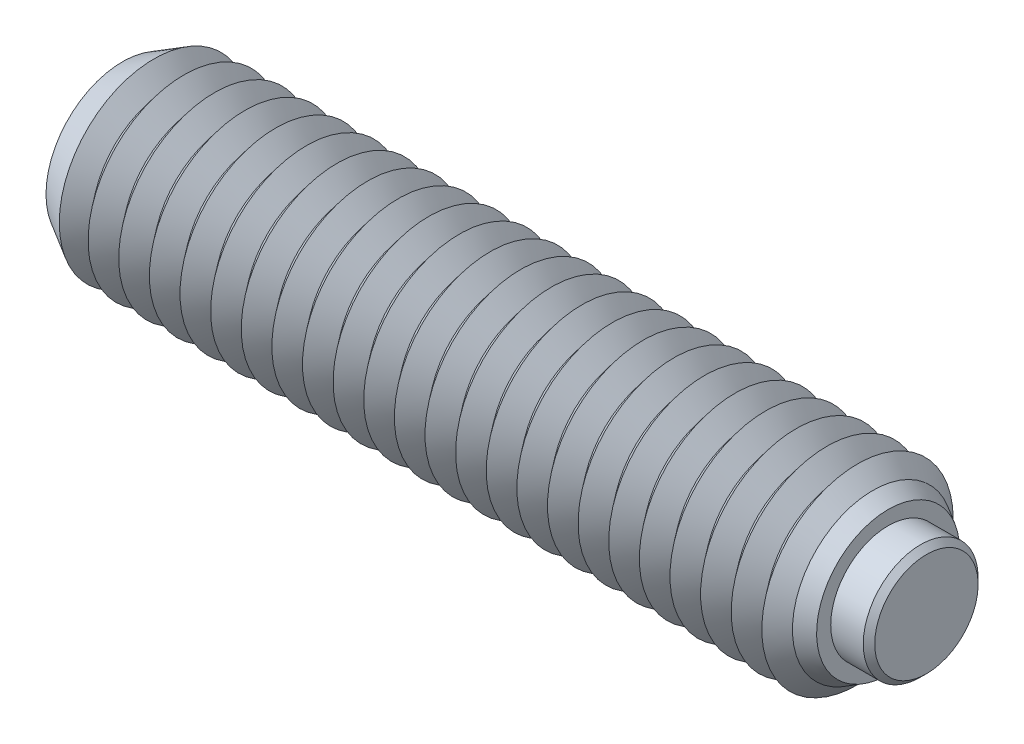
ISO-10303-21;
HEADER;
FILE_DESCRIPTION(('STEP AP214'),'2;1');
FILE_NAME('part.step','',(''),(''),'','','');
FILE_SCHEMA(('AUTOMOTIVE_DESIGN { 1 0 10303 214 1 1 1 1 }'));
ENDSEC;
DATA;
#1=APPLICATION_CONTEXT('core data for automotive mechanical design processes');
#2=APPLICATION_PROTOCOL_DEFINITION('international standard','automotive_design',2000,#1);
#3=PRODUCT_CONTEXT('',#1,'mechanical');
#4=PRODUCT('Part','Part','',(#3));
#5=PRODUCT_RELATED_PRODUCT_CATEGORY('part','',(#4));
#6=PRODUCT_DEFINITION_FORMATION('','',#4);
#7=PRODUCT_DEFINITION_CONTEXT('part definition',#1,'design');
#8=PRODUCT_DEFINITION('design','',#6,#7);
#9=PRODUCT_DEFINITION_SHAPE('','',#8);
#10=(LENGTH_UNIT() NAMED_UNIT(*) SI_UNIT(.MILLI.,.METRE.));
#11=(NAMED_UNIT(*) PLANE_ANGLE_UNIT() SI_UNIT($,.RADIAN.));
#12=(NAMED_UNIT(*) SI_UNIT($,.STERADIAN.) SOLID_ANGLE_UNIT());
#13=UNCERTAINTY_MEASURE_WITH_UNIT(LENGTH_MEASURE(1.E-05),#10,'distance_accuracy_value','');
#14=(GEOMETRIC_REPRESENTATION_CONTEXT(3) GLOBAL_UNCERTAINTY_ASSIGNED_CONTEXT((#13)) GLOBAL_UNIT_ASSIGNED_CONTEXT((#10,
#11,#12)) REPRESENTATION_CONTEXT('',''));
#15=CARTESIAN_POINT('',(0.,0.,0.));
#16=DIRECTION('',(0.,0.,1.));
#17=DIRECTION('',(1.,0.,0.));
#18=AXIS2_PLACEMENT_3D('',#15,#16,#17);
#19=CARTESIAN_POINT('',(1.4,0.,0.));
#20=DIRECTION('',(-1.,0.,0.));
#21=DIRECTION('',(0.,0.,1.));
#22=AXIS2_PLACEMENT_3D('',#19,#20,#21);
#23=CYLINDRICAL_SURFACE('',#22,1.5);
#24=CARTESIAN_POINT('',(1.25,0.,0.));
#25=DIRECTION('',(1.,0.,0.));
#26=DIRECTION('',(0.,0.,-1.));
#27=AXIS2_PLACEMENT_3D('',#24,#25,#26);
#28=CIRCLE('',#27,1.5);
#29=CARTESIAN_POINT('',(1.25,0.,1.5));
#30=VERTEX_POINT('',#29);
#31=EDGE_CURVE('P0_E10',#30,#30,#28,.F.);
#32=ORIENTED_EDGE('',*,*,#31,.T.);
#33=EDGE_LOOP('',(#32));
#34=FACE_BOUND('',#33,.T.);
#35=CARTESIAN_POINT('',(-0.6,0.,0.));
#36=DIRECTION('',(1.,0.,0.));
#37=DIRECTION('',(0.,0.,-1.));
#38=AXIS2_PLACEMENT_3D('',#35,#36,#37);
#39=CIRCLE('',#38,1.5);
#40=CARTESIAN_POINT('',(-0.6,0.,-1.5));
#41=VERTEX_POINT('',#40);
#42=EDGE_CURVE('P0_E25',#41,#41,#39,.T.);
#43=ORIENTED_EDGE('',*,*,#42,.T.);
#44=EDGE_LOOP('',(#43));
#45=FACE_BOUND('',#44,.T.);
#46=ADVANCED_FACE('P0_F14',(#34,#45),#23,.T.);
#47=CARTESIAN_POINT('',(1.4,0.,0.));
#48=DIRECTION('',(1.,0.,0.));
#49=DIRECTION('',(0.,0.,-1.));
#50=AXIS2_PLACEMENT_3D('',#47,#48,#49);
#51=PLANE('',#50);
#52=CARTESIAN_POINT('',(1.4,0.,0.));
#53=DIRECTION('',(1.,0.,0.));
#54=DIRECTION('',(0.,0.,-1.));
#55=AXIS2_PLACEMENT_3D('',#52,#53,#54);
#56=CIRCLE('',#55,1.35);
#57=CARTESIAN_POINT('',(1.4,0.,1.35));
#58=VERTEX_POINT('',#57);
#59=EDGE_CURVE('P0_E21',#58,#58,#56,.T.);
#60=ORIENTED_EDGE('',*,*,#59,.T.);
#61=EDGE_LOOP('',(#60));
#62=FACE_BOUND('',#61,.T.);
#63=ADVANCED_FACE('P0_F35',(#62),#51,.T.);
#64=CARTESIAN_POINT('',(-0.6,0.,0.));
#65=DIRECTION('',(1.,0.,0.));
#66=DIRECTION('',(0.,0.,-1.));
#67=AXIS2_PLACEMENT_3D('',#64,#65,#66);
#68=PLANE('',#67);
#69=ORIENTED_EDGE('',*,*,#42,.F.);
#70=EDGE_LOOP('',(#69));
#71=FACE_BOUND('',#70,.T.);
#72=ADVANCED_FACE('P0_F33',(#71),#68,.F.);
#73=CARTESIAN_POINT('',(1.4,0.,0.));
#74=DIRECTION('',(-1.,0.,0.));
#75=DIRECTION('',(0.,0.,1.));
#76=AXIS2_PLACEMENT_3D('',#73,#74,#75);
#77=CONICAL_SURFACE('',#76,1.35,0.785398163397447);
#78=CARTESIAN_POINT('',(1.25,0.,1.5));
#79=CARTESIAN_POINT('',(1.2515625,0.,1.4984375));
#80=CARTESIAN_POINT('',(1.253125,0.,1.496875));
#81=CARTESIAN_POINT('',(1.25625,0.,1.49375));
#82=CARTESIAN_POINT('',(1.2578125,0.,1.4921875));
#83=CARTESIAN_POINT('',(1.2609375,0.,1.4890625));
#84=CARTESIAN_POINT('',(1.2625,0.,1.4875));
#85=CARTESIAN_POINT('',(1.265625,0.,1.484375));
#86=CARTESIAN_POINT('',(1.2671875,0.,1.4828125));
#87=CARTESIAN_POINT('',(1.2703125,0.,1.4796875));
#88=CARTESIAN_POINT('',(1.271875,0.,1.478125));
#89=CARTESIAN_POINT('',(1.275,0.,1.475));
#90=CARTESIAN_POINT('',(1.2765625,0.,1.4734375));
#91=CARTESIAN_POINT('',(1.2796875,0.,1.4703125));
#92=CARTESIAN_POINT('',(1.28125,0.,1.46875));
#93=CARTESIAN_POINT('',(1.284375,0.,1.465625));
#94=CARTESIAN_POINT('',(1.2859375,0.,1.4640625));
#95=CARTESIAN_POINT('',(1.2890625,0.,1.4609375));
#96=CARTESIAN_POINT('',(1.290625,0.,1.459375));
#97=CARTESIAN_POINT('',(1.29375,0.,1.45625));
#98=CARTESIAN_POINT('',(1.2953125,0.,1.4546875));
#99=CARTESIAN_POINT('',(1.2984375,0.,1.4515625));
#100=CARTESIAN_POINT('',(1.3,0.,1.45));
#101=CARTESIAN_POINT('',(1.303125,0.,1.446875));
#102=CARTESIAN_POINT('',(1.3046875,0.,1.4453125));
#103=CARTESIAN_POINT('',(1.3078125,0.,1.4421875));
#104=CARTESIAN_POINT('',(1.309375,0.,1.440625));
#105=CARTESIAN_POINT('',(1.3125,0.,1.4375));
#106=CARTESIAN_POINT('',(1.3140625,0.,1.4359375));
#107=CARTESIAN_POINT('',(1.3171875,0.,1.4328125));
#108=CARTESIAN_POINT('',(1.31875,0.,1.43125));
#109=CARTESIAN_POINT('',(1.321875,0.,1.428125));
#110=CARTESIAN_POINT('',(1.3234375,0.,1.4265625));
#111=CARTESIAN_POINT('',(1.3265625,0.,1.4234375));
#112=CARTESIAN_POINT('',(1.328125,0.,1.421875));
#113=CARTESIAN_POINT('',(1.33125,0.,1.41875));
#114=CARTESIAN_POINT('',(1.3328125,0.,1.4171875));
#115=CARTESIAN_POINT('',(1.3359375,0.,1.4140625));
#116=CARTESIAN_POINT('',(1.3375,0.,1.4125));
#117=CARTESIAN_POINT('',(1.340625,0.,1.409375));
#118=CARTESIAN_POINT('',(1.3421875,0.,1.4078125));
#119=CARTESIAN_POINT('',(1.3453125,0.,1.4046875));
#120=CARTESIAN_POINT('',(1.346875,0.,1.403125));
#121=CARTESIAN_POINT('',(1.35,0.,1.4));
#122=CARTESIAN_POINT('',(1.3515625,0.,1.3984375));
#123=CARTESIAN_POINT('',(1.3546875,0.,1.3953125));
#124=CARTESIAN_POINT('',(1.35625,0.,1.39375));
#125=CARTESIAN_POINT('',(1.359375,0.,1.390625));
#126=CARTESIAN_POINT('',(1.3609375,0.,1.3890625));
#127=CARTESIAN_POINT('',(1.3640625,0.,1.3859375));
#128=CARTESIAN_POINT('',(1.365625,0.,1.384375));
#129=CARTESIAN_POINT('',(1.36875,0.,1.38125));
#130=CARTESIAN_POINT('',(1.3703125,0.,1.3796875));
#131=CARTESIAN_POINT('',(1.3734375,0.,1.3765625));
#132=CARTESIAN_POINT('',(1.375,0.,1.375));
#133=CARTESIAN_POINT('',(1.378125,0.,1.371875));
#134=CARTESIAN_POINT('',(1.3796875,0.,1.3703125));
#135=CARTESIAN_POINT('',(1.3828125,0.,1.3671875));
#136=CARTESIAN_POINT('',(1.384375,0.,1.365625));
#137=CARTESIAN_POINT('',(1.3875,0.,1.3625));
#138=CARTESIAN_POINT('',(1.3890625,0.,1.3609375));
#139=CARTESIAN_POINT('',(1.3921875,0.,1.3578125));
#140=CARTESIAN_POINT('',(1.39375,0.,1.35625));
#141=CARTESIAN_POINT('',(1.396875,0.,1.353125));
#142=CARTESIAN_POINT('',(1.3984375,0.,1.3515625));
#143=CARTESIAN_POINT('',(1.4,0.,1.35));
#144=B_SPLINE_CURVE_WITH_KNOTS('',3,(#78,#79,#80,#81,#82,#83,#84,#85,#86,#87,#88,#89,#90,#91,
#92,#93,#94,#95,#96,#97,#98,#99,#100,#101,#102,#103,#104,#105,#106,#107,#108,#109,#110,#111,
#112,#113,#114,#115,#116,#117,#118,#119,#120,#121,#122,#123,#124,#125,#126,#127,#128,#129,#130,
#131,#132,#133,#134,#135,#136,#137,#138,#139,#140,#141,#142,#143),.UNSPECIFIED.,.F.,.F.,(4,2,2,
2,2,2,2,2,2,2,2,2,2,2,2,2,2,2,2,2,2,2,2,2,2,2,2,2,2,2,2,2,4),(0.,0.00662912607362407,
0.0132582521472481,0.0198873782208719,0.0265165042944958,0.0331456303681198,0.0397747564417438,
0.0464038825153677,0.0530330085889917,0.0596621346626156,0.0662912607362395,0.0729203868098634,
0.0795495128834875,0.0861786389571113,0.0928077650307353,0.0994368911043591,0.106066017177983,
0.112695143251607,0.119324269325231,0.125953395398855,0.132582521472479,0.139211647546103,
0.145840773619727,0.152469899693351,0.159099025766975,0.165728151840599,0.172357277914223,
0.178986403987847,0.18561553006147,0.192244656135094,0.198873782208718,0.205502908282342,
0.212132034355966),.UNSPECIFIED.);
#145=EDGE_CURVE('P0_BSEAM16',#30,#58,#144,.T.);
#146=ORIENTED_EDGE('',*,*,#31,.F.);
#147=ORIENTED_EDGE('',*,*,#59,.F.);
#148=ORIENTED_EDGE('',*,*,#145,.T.);
#149=ORIENTED_EDGE('',*,*,#145,.F.);
#150=EDGE_LOOP('',(#146,#148,#147,#149));
#151=FACE_BOUND('',#150,.T.);
#152=ADVANCED_FACE('P0_F16',(#151),#77,.T.);
#153=CLOSED_SHELL('',(#46,#63,#72,#152));
#154=MANIFOLD_SOLID_BREP('P0_B1',#153);
#155=CARTESIAN_POINT('',(-18.8,0.,0.));
#156=DIRECTION('',(-1.,0.,0.));
#157=DIRECTION('',(0.,0.,1.));
#158=AXIS2_PLACEMENT_3D('',#155,#156,#157);
#159=CONICAL_SURFACE('',#158,2.5,0.895664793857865);
#160=CARTESIAN_POINT('',(-18.4,0.,0.));
#161=DIRECTION('',(1.,0.,0.));
#162=DIRECTION('',(0.,0.,-1.));
#163=AXIS2_PLACEMENT_3D('',#160,#161,#162);
#164=CIRCLE('',#163,2.00040016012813);
#165=CARTESIAN_POINT('',(-18.4,0.,-2.00040016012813));
#166=VERTEX_POINT('',#165);
#167=EDGE_CURVE('P1_E1087',#166,#166,#164,.T.);
#168=ORIENTED_EDGE('',*,*,#167,.F.);
#169=EDGE_LOOP('',(#168));
#170=FACE_BOUND('',#169,.T.);
#171=CARTESIAN_POINT('',(-18.7793469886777,0.,0.));
#172=DIRECTION('',(1.,0.,0.));
#173=DIRECTION('',(0.,0.,-1.));
#174=AXIS2_PLACEMENT_3D('',#171,#172,#173);
#175=CIRCLE('',#174,2.47420439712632);
#176=CARTESIAN_POINT('',(-18.7793469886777,0.,-2.47420439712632));
#177=VERTEX_POINT('',#176);
#178=EDGE_CURVE('P1_E1090',#177,#177,#175,.F.);
#179=ORIENTED_EDGE('',*,*,#178,.F.);
#180=EDGE_LOOP('',(#179));
#181=FACE_BOUND('',#180,.T.);
#182=ADVANCED_FACE('P1_F15',(#170,#181),#159,.T.);
#183=CARTESIAN_POINT('',(-0.799999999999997,0.,0.));
#184=DIRECTION('',(1.,0.,0.));
#185=DIRECTION('',(0.,0.,-1.));
#186=AXIS2_PLACEMENT_3D('',#183,#184,#185);
#187=CONICAL_SURFACE('',#186,2.00040016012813,0.895664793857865);
#188=CARTESIAN_POINT('',(-0.399999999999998,0.,0.));
#189=DIRECTION('',(1.,0.,0.));
#190=DIRECTION('',(0.,0.,-1.));
#191=AXIS2_PLACEMENT_3D('',#188,#189,#190);
#192=CIRCLE('',#191,2.5);
#193=CARTESIAN_POINT('',(-0.399999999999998,0.,-2.5));
#194=VERTEX_POINT('',#193);
#195=EDGE_CURVE('P1_E951',#194,#194,#192,.T.);
#196=ORIENTED_EDGE('',*,*,#195,.F.);
#197=EDGE_LOOP('',(#196));
#198=FACE_BOUND('',#197,.T.);
#199=CARTESIAN_POINT('',(-0.799999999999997,0.,0.));
#200=DIRECTION('',(1.,0.,0.));
#201=DIRECTION('',(0.,0.,-1.));
#202=AXIS2_PLACEMENT_3D('',#199,#200,#201);
#203=CIRCLE('',#202,2.00040016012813);
#204=CARTESIAN_POINT('',(-0.799999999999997,0.,-2.00040016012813));
#205=VERTEX_POINT('',#204);
#206=EDGE_CURVE('P1_E952',#205,#205,#203,.T.);
#207=ORIENTED_EDGE('',*,*,#206,.T.);
#208=EDGE_LOOP('',(#207));
#209=FACE_BOUND('',#208,.T.);
#210=ADVANCED_FACE('P1_F222',(#198,#209),#187,.T.);
#211=CARTESIAN_POINT('',(-1.2,0.,0.));
#212=DIRECTION('',(-1.,0.,0.));
#213=DIRECTION('',(0.,0.,1.));
#214=AXIS2_PLACEMENT_3D('',#211,#212,#213);
#215=CONICAL_SURFACE('',#214,2.5,0.895664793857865);
#216=ORIENTED_EDGE('',*,*,#206,.F.);
#217=EDGE_LOOP('',(#216));
#218=FACE_BOUND('',#217,.T.);
#219=CARTESIAN_POINT('',(-1.2,0.,0.));
#220=DIRECTION('',(1.,0.,0.));
#221=DIRECTION('',(0.,0.,-1.));
#222=AXIS2_PLACEMENT_3D('',#219,#220,#221);
#223=CIRCLE('',#222,2.5);
#224=CARTESIAN_POINT('',(-1.2,0.,-2.5));
#225=VERTEX_POINT('',#224);
#226=EDGE_CURVE('P1_E956',#225,#225,#223,.T.);
#227=ORIENTED_EDGE('',*,*,#226,.T.);
#228=EDGE_LOOP('',(#227));
#229=FACE_BOUND('',#228,.T.);
#230=ADVANCED_FACE('P1_F227',(#218,#229),#215,.T.);
#231=CARTESIAN_POINT('',(-0.6,0.,0.));
#232=DIRECTION('',(1.,0.,0.));
#233=DIRECTION('',(0.,1.,0.));
#234=AXIS2_PLACEMENT_3D('',#231,#232,#233);
#235=PLANE('',#234);
#236=CARTESIAN_POINT('',(-0.6,0.,0.));
#237=DIRECTION('',(1.,0.,0.));
#238=DIRECTION('',(0.,1.,0.));
#239=AXIS2_PLACEMENT_3D('',#236,#237,#238);
#240=CIRCLE('',#239,1.5);
#241=CARTESIAN_POINT('',(-0.6,1.5,0.));
#242=VERTEX_POINT('',#241);
#243=EDGE_CURVE('P1_E478',#242,#242,#240,.T.);
#244=ORIENTED_EDGE('',*,*,#243,.T.);
#245=EDGE_LOOP('',(#244));
#246=FACE_BOUND('',#245,.T.);
#247=ADVANCED_FACE('P1_F405',(#246),#235,.T.);
#248=CARTESIAN_POINT('',(-0.6,0.,0.));
#249=DIRECTION('',(1.,0.,0.));
#250=DIRECTION('',(0.,1.,0.));
#251=AXIS2_PLACEMENT_3D('',#248,#249,#250);
#252=CYLINDRICAL_SURFACE('',#251,1.5);
#253=ORIENTED_EDGE('',*,*,#243,.F.);
#254=EDGE_LOOP('',(#253));
#255=FACE_BOUND('',#254,.T.);
#256=CARTESIAN_POINT('',(0.4,0.,0.));
#257=DIRECTION('',(1.,0.,0.));
#258=DIRECTION('',(0.,1.,0.));
#259=AXIS2_PLACEMENT_3D('',#256,#257,#258);
#260=CIRCLE('',#259,1.5);
#261=CARTESIAN_POINT('',(0.4,1.5,0.));
#262=VERTEX_POINT('',#261);
#263=EDGE_CURVE('P1_E481',#262,#262,#260,.T.);
#264=ORIENTED_EDGE('',*,*,#263,.T.);
#265=EDGE_LOOP('',(#264));
#266=FACE_BOUND('',#265,.T.);
#267=ADVANCED_FACE('P1_F209',(#255,#266),#252,.F.);
#268=CARTESIAN_POINT('',(0.4,1.86905989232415,0.));
#269=DIRECTION('',(1.,0.,0.));
#270=DIRECTION('',(0.,1.,0.));
#271=AXIS2_PLACEMENT_3D('',#268,#269,#270);
#272=PLANE('',#271);
#273=ORIENTED_EDGE('',*,*,#263,.F.);
#274=EDGE_LOOP('',(#273));
#275=FACE_BOUND('',#274,.T.);
#276=CARTESIAN_POINT('',(0.4,0.,0.));
#277=DIRECTION('',(1.,0.,0.));
#278=DIRECTION('',(0.,1.,0.));
#279=AXIS2_PLACEMENT_3D('',#276,#277,#278);
#280=CIRCLE('',#279,1.86905989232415);
#281=CARTESIAN_POINT('',(0.4,1.86905989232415,0.));
#282=VERTEX_POINT('',#281);
#283=EDGE_CURVE('P1_E121',#282,#282,#280,.T.);
#284=ORIENTED_EDGE('',*,*,#283,.T.);
#285=EDGE_LOOP('',(#284));
#286=FACE_BOUND('',#285,.T.);
#287=ADVANCED_FACE('P1_F206',(#275,#286),#272,.T.);
#288=CARTESIAN_POINT('',(0.4,0.,0.));
#289=DIRECTION('',(-1.,0.,0.));
#290=DIRECTION('',(0.,-1.,0.));
#291=AXIS2_PLACEMENT_3D('',#288,#289,#290);
#292=CONICAL_SURFACE('',#291,1.86905989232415,0.523598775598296);
#293=CARTESIAN_POINT('',(0.,0.,0.));
#294=DIRECTION('',(1.,0.,0.));
#295=DIRECTION('',(0.,0.,-1.));
#296=AXIS2_PLACEMENT_3D('',#293,#294,#295);
#297=CIRCLE('',#296,2.1);
#298=CARTESIAN_POINT('',(0.,0.,-2.1));
#299=VERTEX_POINT('',#298);
#300=EDGE_CURVE('P1_E469',#299,#299,#297,.T.);
#301=ORIENTED_EDGE('',*,*,#300,.T.);
#302=EDGE_LOOP('',(#301));
#303=FACE_BOUND('',#302,.T.);
#304=ORIENTED_EDGE('',*,*,#283,.F.);
#305=EDGE_LOOP('',(#304));
#306=FACE_BOUND('',#305,.T.);
#307=ADVANCED_FACE('P1_F203',(#303,#306),#292,.T.);
#308=CARTESIAN_POINT('',(0.,0.,0.));
#309=DIRECTION('',(-1.,0.,0.));
#310=DIRECTION('',(0.,0.,1.));
#311=AXIS2_PLACEMENT_3D('',#308,#309,#310);
#312=CONICAL_SURFACE('',#311,2.1,0.785398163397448);
#313=ORIENTED_EDGE('',*,*,#195,.T.);
#314=EDGE_LOOP('',(#313));
#315=FACE_BOUND('',#314,.T.);
#316=ORIENTED_EDGE('',*,*,#300,.F.);
#317=EDGE_LOOP('',(#316));
#318=FACE_BOUND('',#317,.T.);
#319=ADVANCED_FACE('P1_F17',(#315,#318),#312,.T.);
#320=CARTESIAN_POINT('',(-1.6,0.,0.));
#321=DIRECTION('',(1.,0.,0.));
#322=DIRECTION('',(0.,0.,-1.));
#323=AXIS2_PLACEMENT_3D('',#320,#321,#322);
#324=CONICAL_SURFACE('',#323,2.00040016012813,0.895664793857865);
#325=ORIENTED_EDGE('',*,*,#226,.F.);
#326=EDGE_LOOP('',(#325));
#327=FACE_BOUND('',#326,.T.);
#328=CARTESIAN_POINT('',(-1.6,0.,0.));
#329=DIRECTION('',(1.,0.,0.));
#330=DIRECTION('',(0.,0.,-1.));
#331=AXIS2_PLACEMENT_3D('',#328,#329,#330);
#332=CIRCLE('',#331,2.00040016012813);
#333=CARTESIAN_POINT('',(-1.6,0.,-2.00040016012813));
#334=VERTEX_POINT('',#333);
#335=EDGE_CURVE('P1_E961',#334,#334,#332,.T.);
#336=ORIENTED_EDGE('',*,*,#335,.T.);
#337=EDGE_LOOP('',(#336));
#338=FACE_BOUND('',#337,.T.);
#339=ADVANCED_FACE('P1_F399',(#327,#338),#324,.T.);
#340=CARTESIAN_POINT('',(-2.,0.,0.));
#341=DIRECTION('',(-1.,0.,0.));
#342=DIRECTION('',(0.,0.,1.));
#343=AXIS2_PLACEMENT_3D('',#340,#341,#342);
#344=CONICAL_SURFACE('',#343,2.5,0.895664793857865);
#345=ORIENTED_EDGE('',*,*,#335,.F.);
#346=EDGE_LOOP('',(#345));
#347=FACE_BOUND('',#346,.T.);
#348=CARTESIAN_POINT('',(-2.,0.,0.));
#349=DIRECTION('',(1.,0.,0.));
#350=DIRECTION('',(0.,0.,-1.));
#351=AXIS2_PLACEMENT_3D('',#348,#349,#350);
#352=CIRCLE('',#351,2.5);
#353=CARTESIAN_POINT('',(-2.,0.,-2.5));
#354=VERTEX_POINT('',#353);
#355=EDGE_CURVE('P1_E964',#354,#354,#352,.T.);
#356=ORIENTED_EDGE('',*,*,#355,.T.);
#357=EDGE_LOOP('',(#356));
#358=FACE_BOUND('',#357,.T.);
#359=ADVANCED_FACE('P1_F395',(#347,#358),#344,.T.);
#360=CARTESIAN_POINT('',(-2.4,0.,0.));
#361=DIRECTION('',(1.,0.,0.));
#362=DIRECTION('',(0.,0.,-1.));
#363=AXIS2_PLACEMENT_3D('',#360,#361,#362);
#364=CONICAL_SURFACE('',#363,2.00040016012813,0.895664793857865);
#365=ORIENTED_EDGE('',*,*,#355,.F.);
#366=EDGE_LOOP('',(#365));
#367=FACE_BOUND('',#366,.T.);
#368=CARTESIAN_POINT('',(-2.4,0.,0.));
#369=DIRECTION('',(1.,0.,0.));
#370=DIRECTION('',(0.,0.,-1.));
#371=AXIS2_PLACEMENT_3D('',#368,#369,#370);
#372=CIRCLE('',#371,2.00040016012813);
#373=CARTESIAN_POINT('',(-2.4,0.,-2.00040016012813));
#374=VERTEX_POINT('',#373);
#375=EDGE_CURVE('P1_E967',#374,#374,#372,.T.);
#376=ORIENTED_EDGE('',*,*,#375,.T.);
#377=EDGE_LOOP('',(#376));
#378=FACE_BOUND('',#377,.T.);
#379=ADVANCED_FACE('P1_F391',(#367,#378),#364,.T.);
#380=CARTESIAN_POINT('',(-2.8,0.,0.));
#381=DIRECTION('',(-1.,0.,0.));
#382=DIRECTION('',(0.,0.,1.));
#383=AXIS2_PLACEMENT_3D('',#380,#381,#382);
#384=CONICAL_SURFACE('',#383,2.5,0.895664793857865);
#385=ORIENTED_EDGE('',*,*,#375,.F.);
#386=EDGE_LOOP('',(#385));
#387=FACE_BOUND('',#386,.T.);
#388=CARTESIAN_POINT('',(-2.8,0.,0.));
#389=DIRECTION('',(1.,0.,0.));
#390=DIRECTION('',(0.,0.,-1.));
#391=AXIS2_PLACEMENT_3D('',#388,#389,#390);
#392=CIRCLE('',#391,2.5);
#393=CARTESIAN_POINT('',(-2.8,0.,-2.5));
#394=VERTEX_POINT('',#393);
#395=EDGE_CURVE('P1_E970',#394,#394,#392,.T.);
#396=ORIENTED_EDGE('',*,*,#395,.T.);
#397=EDGE_LOOP('',(#396));
#398=FACE_BOUND('',#397,.T.);
#399=ADVANCED_FACE('P1_F387',(#387,#398),#384,.T.);
#400=CARTESIAN_POINT('',(-3.2,0.,0.));
#401=DIRECTION('',(1.,0.,0.));
#402=DIRECTION('',(0.,0.,-1.));
#403=AXIS2_PLACEMENT_3D('',#400,#401,#402);
#404=CONICAL_SURFACE('',#403,2.00040016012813,0.895664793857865);
#405=ORIENTED_EDGE('',*,*,#395,.F.);
#406=EDGE_LOOP('',(#405));
#407=FACE_BOUND('',#406,.T.);
#408=CARTESIAN_POINT('',(-3.2,0.,0.));
#409=DIRECTION('',(1.,0.,0.));
#410=DIRECTION('',(0.,0.,-1.));
#411=AXIS2_PLACEMENT_3D('',#408,#409,#410);
#412=CIRCLE('',#411,2.00040016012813);
#413=CARTESIAN_POINT('',(-3.2,0.,-2.00040016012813));
#414=VERTEX_POINT('',#413);
#415=EDGE_CURVE('P1_E973',#414,#414,#412,.T.);
#416=ORIENTED_EDGE('',*,*,#415,.T.);
#417=EDGE_LOOP('',(#416));
#418=FACE_BOUND('',#417,.T.);
#419=ADVANCED_FACE('P1_F383',(#407,#418),#404,.T.);
#420=CARTESIAN_POINT('',(-3.6,0.,0.));
#421=DIRECTION('',(-1.,0.,0.));
#422=DIRECTION('',(0.,0.,1.));
#423=AXIS2_PLACEMENT_3D('',#420,#421,#422);
#424=CONICAL_SURFACE('',#423,2.5,0.895664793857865);
#425=ORIENTED_EDGE('',*,*,#415,.F.);
#426=EDGE_LOOP('',(#425));
#427=FACE_BOUND('',#426,.T.);
#428=CARTESIAN_POINT('',(-3.6,0.,0.));
#429=DIRECTION('',(1.,0.,0.));
#430=DIRECTION('',(0.,0.,-1.));
#431=AXIS2_PLACEMENT_3D('',#428,#429,#430);
#432=CIRCLE('',#431,2.5);
#433=CARTESIAN_POINT('',(-3.6,0.,-2.5));
#434=VERTEX_POINT('',#433);
#435=EDGE_CURVE('P1_E976',#434,#434,#432,.T.);
#436=ORIENTED_EDGE('',*,*,#435,.T.);
#437=EDGE_LOOP('',(#436));
#438=FACE_BOUND('',#437,.T.);
#439=ADVANCED_FACE('P1_F379',(#427,#438),#424,.T.);
#440=CARTESIAN_POINT('',(-4.,0.,0.));
#441=DIRECTION('',(1.,0.,0.));
#442=DIRECTION('',(0.,0.,-1.));
#443=AXIS2_PLACEMENT_3D('',#440,#441,#442);
#444=CONICAL_SURFACE('',#443,2.00040016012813,0.895664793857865);
#445=ORIENTED_EDGE('',*,*,#435,.F.);
#446=EDGE_LOOP('',(#445));
#447=FACE_BOUND('',#446,.T.);
#448=CARTESIAN_POINT('',(-4.,0.,0.));
#449=DIRECTION('',(1.,0.,0.));
#450=DIRECTION('',(0.,0.,-1.));
#451=AXIS2_PLACEMENT_3D('',#448,#449,#450);
#452=CIRCLE('',#451,2.00040016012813);
#453=CARTESIAN_POINT('',(-4.,0.,-2.00040016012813));
#454=VERTEX_POINT('',#453);
#455=EDGE_CURVE('P1_E979',#454,#454,#452,.T.);
#456=ORIENTED_EDGE('',*,*,#455,.T.);
#457=EDGE_LOOP('',(#456));
#458=FACE_BOUND('',#457,.T.);
#459=ADVANCED_FACE('P1_F375',(#447,#458),#444,.T.);
#460=CARTESIAN_POINT('',(-4.4,0.,0.));
#461=DIRECTION('',(-1.,0.,0.));
#462=DIRECTION('',(0.,0.,1.));
#463=AXIS2_PLACEMENT_3D('',#460,#461,#462);
#464=CONICAL_SURFACE('',#463,2.5,0.895664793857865);
#465=ORIENTED_EDGE('',*,*,#455,.F.);
#466=EDGE_LOOP('',(#465));
#467=FACE_BOUND('',#466,.T.);
#468=CARTESIAN_POINT('',(-4.4,0.,0.));
#469=DIRECTION('',(1.,0.,0.));
#470=DIRECTION('',(0.,0.,-1.));
#471=AXIS2_PLACEMENT_3D('',#468,#469,#470);
#472=CIRCLE('',#471,2.5);
#473=CARTESIAN_POINT('',(-4.4,0.,-2.5));
#474=VERTEX_POINT('',#473);
#475=EDGE_CURVE('P1_E982',#474,#474,#472,.T.);
#476=ORIENTED_EDGE('',*,*,#475,.T.);
#477=EDGE_LOOP('',(#476));
#478=FACE_BOUND('',#477,.T.);
#479=ADVANCED_FACE('P1_F371',(#467,#478),#464,.T.);
#480=CARTESIAN_POINT('',(-4.8,0.,0.));
#481=DIRECTION('',(1.,0.,0.));
#482=DIRECTION('',(0.,0.,-1.));
#483=AXIS2_PLACEMENT_3D('',#480,#481,#482);
#484=CONICAL_SURFACE('',#483,2.00040016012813,0.895664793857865);
#485=ORIENTED_EDGE('',*,*,#475,.F.);
#486=EDGE_LOOP('',(#485));
#487=FACE_BOUND('',#486,.T.);
#488=CARTESIAN_POINT('',(-4.8,0.,0.));
#489=DIRECTION('',(1.,0.,0.));
#490=DIRECTION('',(0.,0.,-1.));
#491=AXIS2_PLACEMENT_3D('',#488,#489,#490);
#492=CIRCLE('',#491,2.00040016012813);
#493=CARTESIAN_POINT('',(-4.8,0.,-2.00040016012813));
#494=VERTEX_POINT('',#493);
#495=EDGE_CURVE('P1_E985',#494,#494,#492,.T.);
#496=ORIENTED_EDGE('',*,*,#495,.T.);
#497=EDGE_LOOP('',(#496));
#498=FACE_BOUND('',#497,.T.);
#499=ADVANCED_FACE('P1_F367',(#487,#498),#484,.T.);
#500=CARTESIAN_POINT('',(-5.2,0.,0.));
#501=DIRECTION('',(-1.,0.,0.));
#502=DIRECTION('',(0.,0.,1.));
#503=AXIS2_PLACEMENT_3D('',#500,#501,#502);
#504=CONICAL_SURFACE('',#503,2.5,0.895664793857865);
#505=ORIENTED_EDGE('',*,*,#495,.F.);
#506=EDGE_LOOP('',(#505));
#507=FACE_BOUND('',#506,.T.);
#508=CARTESIAN_POINT('',(-5.2,0.,0.));
#509=DIRECTION('',(1.,0.,0.));
#510=DIRECTION('',(0.,0.,-1.));
#511=AXIS2_PLACEMENT_3D('',#508,#509,#510);
#512=CIRCLE('',#511,2.5);
#513=CARTESIAN_POINT('',(-5.2,0.,-2.5));
#514=VERTEX_POINT('',#513);
#515=EDGE_CURVE('P1_E988',#514,#514,#512,.T.);
#516=ORIENTED_EDGE('',*,*,#515,.T.);
#517=EDGE_LOOP('',(#516));
#518=FACE_BOUND('',#517,.T.);
#519=ADVANCED_FACE('P1_F363',(#507,#518),#504,.T.);
#520=CARTESIAN_POINT('',(-5.6,0.,0.));
#521=DIRECTION('',(1.,0.,0.));
#522=DIRECTION('',(0.,0.,-1.));
#523=AXIS2_PLACEMENT_3D('',#520,#521,#522);
#524=CONICAL_SURFACE('',#523,2.00040016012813,0.895664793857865);
#525=ORIENTED_EDGE('',*,*,#515,.F.);
#526=EDGE_LOOP('',(#525));
#527=FACE_BOUND('',#526,.T.);
#528=CARTESIAN_POINT('',(-5.6,0.,0.));
#529=DIRECTION('',(1.,0.,0.));
#530=DIRECTION('',(0.,0.,-1.));
#531=AXIS2_PLACEMENT_3D('',#528,#529,#530);
#532=CIRCLE('',#531,2.00040016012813);
#533=CARTESIAN_POINT('',(-5.6,0.,-2.00040016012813));
#534=VERTEX_POINT('',#533);
#535=EDGE_CURVE('P1_E991',#534,#534,#532,.T.);
#536=ORIENTED_EDGE('',*,*,#535,.T.);
#537=EDGE_LOOP('',(#536));
#538=FACE_BOUND('',#537,.T.);
#539=ADVANCED_FACE('P1_F359',(#527,#538),#524,.T.);
#540=CARTESIAN_POINT('',(-6.,0.,0.));
#541=DIRECTION('',(-1.,0.,0.));
#542=DIRECTION('',(0.,0.,1.));
#543=AXIS2_PLACEMENT_3D('',#540,#541,#542);
#544=CONICAL_SURFACE('',#543,2.5,0.895664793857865);
#545=ORIENTED_EDGE('',*,*,#535,.F.);
#546=EDGE_LOOP('',(#545));
#547=FACE_BOUND('',#546,.T.);
#548=CARTESIAN_POINT('',(-6.,0.,0.));
#549=DIRECTION('',(1.,0.,0.));
#550=DIRECTION('',(0.,0.,-1.));
#551=AXIS2_PLACEMENT_3D('',#548,#549,#550);
#552=CIRCLE('',#551,2.5);
#553=CARTESIAN_POINT('',(-6.,0.,-2.5));
#554=VERTEX_POINT('',#553);
#555=EDGE_CURVE('P1_E994',#554,#554,#552,.T.);
#556=ORIENTED_EDGE('',*,*,#555,.T.);
#557=EDGE_LOOP('',(#556));
#558=FACE_BOUND('',#557,.T.);
#559=ADVANCED_FACE('P1_F355',(#547,#558),#544,.T.);
#560=CARTESIAN_POINT('',(-6.4,0.,0.));
#561=DIRECTION('',(1.,0.,0.));
#562=DIRECTION('',(0.,0.,-1.));
#563=AXIS2_PLACEMENT_3D('',#560,#561,#562);
#564=CONICAL_SURFACE('',#563,2.00040016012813,0.895664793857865);
#565=ORIENTED_EDGE('',*,*,#555,.F.);
#566=EDGE_LOOP('',(#565));
#567=FACE_BOUND('',#566,.T.);
#568=CARTESIAN_POINT('',(-6.4,0.,0.));
#569=DIRECTION('',(1.,0.,0.));
#570=DIRECTION('',(0.,0.,-1.));
#571=AXIS2_PLACEMENT_3D('',#568,#569,#570);
#572=CIRCLE('',#571,2.00040016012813);
#573=CARTESIAN_POINT('',(-6.4,0.,-2.00040016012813));
#574=VERTEX_POINT('',#573);
#575=EDGE_CURVE('P1_E997',#574,#574,#572,.T.);
#576=ORIENTED_EDGE('',*,*,#575,.T.);
#577=EDGE_LOOP('',(#576));
#578=FACE_BOUND('',#577,.T.);
#579=ADVANCED_FACE('P1_F351',(#567,#578),#564,.T.);
#580=CARTESIAN_POINT('',(-6.8,0.,0.));
#581=DIRECTION('',(-1.,0.,0.));
#582=DIRECTION('',(0.,0.,1.));
#583=AXIS2_PLACEMENT_3D('',#580,#581,#582);
#584=CONICAL_SURFACE('',#583,2.5,0.895664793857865);
#585=ORIENTED_EDGE('',*,*,#575,.F.);
#586=EDGE_LOOP('',(#585));
#587=FACE_BOUND('',#586,.T.);
#588=CARTESIAN_POINT('',(-6.8,0.,0.));
#589=DIRECTION('',(1.,0.,0.));
#590=DIRECTION('',(0.,0.,-1.));
#591=AXIS2_PLACEMENT_3D('',#588,#589,#590);
#592=CIRCLE('',#591,2.5);
#593=CARTESIAN_POINT('',(-6.8,0.,-2.5));
#594=VERTEX_POINT('',#593);
#595=EDGE_CURVE('P1_E1000',#594,#594,#592,.T.);
#596=ORIENTED_EDGE('',*,*,#595,.T.);
#597=EDGE_LOOP('',(#596));
#598=FACE_BOUND('',#597,.T.);
#599=ADVANCED_FACE('P1_F347',(#587,#598),#584,.T.);
#600=CARTESIAN_POINT('',(-7.2,0.,0.));
#601=DIRECTION('',(1.,0.,0.));
#602=DIRECTION('',(0.,0.,-1.));
#603=AXIS2_PLACEMENT_3D('',#600,#601,#602);
#604=CONICAL_SURFACE('',#603,2.00040016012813,0.895664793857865);
#605=ORIENTED_EDGE('',*,*,#595,.F.);
#606=EDGE_LOOP('',(#605));
#607=FACE_BOUND('',#606,.T.);
#608=CARTESIAN_POINT('',(-7.2,0.,0.));
#609=DIRECTION('',(1.,0.,0.));
#610=DIRECTION('',(0.,0.,-1.));
#611=AXIS2_PLACEMENT_3D('',#608,#609,#610);
#612=CIRCLE('',#611,2.00040016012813);
#613=CARTESIAN_POINT('',(-7.2,0.,-2.00040016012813));
#614=VERTEX_POINT('',#613);
#615=EDGE_CURVE('P1_E1003',#614,#614,#612,.T.);
#616=ORIENTED_EDGE('',*,*,#615,.T.);
#617=EDGE_LOOP('',(#616));
#618=FACE_BOUND('',#617,.T.);
#619=ADVANCED_FACE('P1_F343',(#607,#618),#604,.T.);
#620=CARTESIAN_POINT('',(-7.6,0.,0.));
#621=DIRECTION('',(-1.,0.,0.));
#622=DIRECTION('',(0.,0.,1.));
#623=AXIS2_PLACEMENT_3D('',#620,#621,#622);
#624=CONICAL_SURFACE('',#623,2.5,0.895664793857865);
#625=ORIENTED_EDGE('',*,*,#615,.F.);
#626=EDGE_LOOP('',(#625));
#627=FACE_BOUND('',#626,.T.);
#628=CARTESIAN_POINT('',(-7.6,0.,0.));
#629=DIRECTION('',(1.,0.,0.));
#630=DIRECTION('',(0.,0.,-1.));
#631=AXIS2_PLACEMENT_3D('',#628,#629,#630);
#632=CIRCLE('',#631,2.5);
#633=CARTESIAN_POINT('',(-7.6,0.,-2.5));
#634=VERTEX_POINT('',#633);
#635=EDGE_CURVE('P1_E1006',#634,#634,#632,.T.);
#636=ORIENTED_EDGE('',*,*,#635,.T.);
#637=EDGE_LOOP('',(#636));
#638=FACE_BOUND('',#637,.T.);
#639=ADVANCED_FACE('P1_F339',(#627,#638),#624,.T.);
#640=CARTESIAN_POINT('',(-8.,0.,0.));
#641=DIRECTION('',(1.,0.,0.));
#642=DIRECTION('',(0.,0.,-1.));
#643=AXIS2_PLACEMENT_3D('',#640,#641,#642);
#644=CONICAL_SURFACE('',#643,2.00040016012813,0.895664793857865);
#645=ORIENTED_EDGE('',*,*,#635,.F.);
#646=EDGE_LOOP('',(#645));
#647=FACE_BOUND('',#646,.T.);
#648=CARTESIAN_POINT('',(-8.,0.,0.));
#649=DIRECTION('',(1.,0.,0.));
#650=DIRECTION('',(0.,0.,-1.));
#651=AXIS2_PLACEMENT_3D('',#648,#649,#650);
#652=CIRCLE('',#651,2.00040016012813);
#653=CARTESIAN_POINT('',(-8.,0.,-2.00040016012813));
#654=VERTEX_POINT('',#653);
#655=EDGE_CURVE('P1_E1009',#654,#654,#652,.T.);
#656=ORIENTED_EDGE('',*,*,#655,.T.);
#657=EDGE_LOOP('',(#656));
#658=FACE_BOUND('',#657,.T.);
#659=ADVANCED_FACE('P1_F335',(#647,#658),#644,.T.);
#660=CARTESIAN_POINT('',(-8.4,0.,0.));
#661=DIRECTION('',(-1.,0.,0.));
#662=DIRECTION('',(0.,0.,1.));
#663=AXIS2_PLACEMENT_3D('',#660,#661,#662);
#664=CONICAL_SURFACE('',#663,2.5,0.895664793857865);
#665=ORIENTED_EDGE('',*,*,#655,.F.);
#666=EDGE_LOOP('',(#665));
#667=FACE_BOUND('',#666,.T.);
#668=CARTESIAN_POINT('',(-8.4,0.,0.));
#669=DIRECTION('',(1.,0.,0.));
#670=DIRECTION('',(0.,0.,-1.));
#671=AXIS2_PLACEMENT_3D('',#668,#669,#670);
#672=CIRCLE('',#671,2.5);
#673=CARTESIAN_POINT('',(-8.4,0.,-2.5));
#674=VERTEX_POINT('',#673);
#675=EDGE_CURVE('P1_E1012',#674,#674,#672,.T.);
#676=ORIENTED_EDGE('',*,*,#675,.T.);
#677=EDGE_LOOP('',(#676));
#678=FACE_BOUND('',#677,.T.);
#679=ADVANCED_FACE('P1_F331',(#667,#678),#664,.T.);
#680=CARTESIAN_POINT('',(-8.8,0.,0.));
#681=DIRECTION('',(1.,0.,0.));
#682=DIRECTION('',(0.,0.,-1.));
#683=AXIS2_PLACEMENT_3D('',#680,#681,#682);
#684=CONICAL_SURFACE('',#683,2.00040016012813,0.895664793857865);
#685=ORIENTED_EDGE('',*,*,#675,.F.);
#686=EDGE_LOOP('',(#685));
#687=FACE_BOUND('',#686,.T.);
#688=CARTESIAN_POINT('',(-8.8,0.,0.));
#689=DIRECTION('',(1.,0.,0.));
#690=DIRECTION('',(0.,0.,-1.));
#691=AXIS2_PLACEMENT_3D('',#688,#689,#690);
#692=CIRCLE('',#691,2.00040016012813);
#693=CARTESIAN_POINT('',(-8.8,0.,-2.00040016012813));
#694=VERTEX_POINT('',#693);
#695=EDGE_CURVE('P1_E1015',#694,#694,#692,.T.);
#696=ORIENTED_EDGE('',*,*,#695,.T.);
#697=EDGE_LOOP('',(#696));
#698=FACE_BOUND('',#697,.T.);
#699=ADVANCED_FACE('P1_F327',(#687,#698),#684,.T.);
#700=CARTESIAN_POINT('',(-9.2,0.,0.));
#701=DIRECTION('',(-1.,0.,0.));
#702=DIRECTION('',(0.,0.,1.));
#703=AXIS2_PLACEMENT_3D('',#700,#701,#702);
#704=CONICAL_SURFACE('',#703,2.5,0.895664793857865);
#705=ORIENTED_EDGE('',*,*,#695,.F.);
#706=EDGE_LOOP('',(#705));
#707=FACE_BOUND('',#706,.T.);
#708=CARTESIAN_POINT('',(-9.2,0.,0.));
#709=DIRECTION('',(1.,0.,0.));
#710=DIRECTION('',(0.,0.,-1.));
#711=AXIS2_PLACEMENT_3D('',#708,#709,#710);
#712=CIRCLE('',#711,2.5);
#713=CARTESIAN_POINT('',(-9.2,0.,-2.5));
#714=VERTEX_POINT('',#713);
#715=EDGE_CURVE('P1_E1018',#714,#714,#712,.T.);
#716=ORIENTED_EDGE('',*,*,#715,.T.);
#717=EDGE_LOOP('',(#716));
#718=FACE_BOUND('',#717,.T.);
#719=ADVANCED_FACE('P1_F323',(#707,#718),#704,.T.);
#720=CARTESIAN_POINT('',(-9.6,0.,0.));
#721=DIRECTION('',(1.,0.,0.));
#722=DIRECTION('',(0.,0.,-1.));
#723=AXIS2_PLACEMENT_3D('',#720,#721,#722);
#724=CONICAL_SURFACE('',#723,2.00040016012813,0.895664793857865);
#725=ORIENTED_EDGE('',*,*,#715,.F.);
#726=EDGE_LOOP('',(#725));
#727=FACE_BOUND('',#726,.T.);
#728=CARTESIAN_POINT('',(-9.6,0.,0.));
#729=DIRECTION('',(1.,0.,0.));
#730=DIRECTION('',(0.,0.,-1.));
#731=AXIS2_PLACEMENT_3D('',#728,#729,#730);
#732=CIRCLE('',#731,2.00040016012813);
#733=CARTESIAN_POINT('',(-9.6,0.,-2.00040016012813));
#734=VERTEX_POINT('',#733);
#735=EDGE_CURVE('P1_E1021',#734,#734,#732,.T.);
#736=ORIENTED_EDGE('',*,*,#735,.T.);
#737=EDGE_LOOP('',(#736));
#738=FACE_BOUND('',#737,.T.);
#739=ADVANCED_FACE('P1_F319',(#727,#738),#724,.T.);
#740=CARTESIAN_POINT('',(-10.,0.,0.));
#741=DIRECTION('',(-1.,0.,0.));
#742=DIRECTION('',(0.,0.,1.));
#743=AXIS2_PLACEMENT_3D('',#740,#741,#742);
#744=CONICAL_SURFACE('',#743,2.5,0.895664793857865);
#745=ORIENTED_EDGE('',*,*,#735,.F.);
#746=EDGE_LOOP('',(#745));
#747=FACE_BOUND('',#746,.T.);
#748=CARTESIAN_POINT('',(-10.,0.,0.));
#749=DIRECTION('',(1.,0.,0.));
#750=DIRECTION('',(0.,0.,-1.));
#751=AXIS2_PLACEMENT_3D('',#748,#749,#750);
#752=CIRCLE('',#751,2.5);
#753=CARTESIAN_POINT('',(-10.,0.,-2.5));
#754=VERTEX_POINT('',#753);
#755=EDGE_CURVE('P1_E1024',#754,#754,#752,.T.);
#756=ORIENTED_EDGE('',*,*,#755,.T.);
#757=EDGE_LOOP('',(#756));
#758=FACE_BOUND('',#757,.T.);
#759=ADVANCED_FACE('P1_F315',(#747,#758),#744,.T.);
#760=CARTESIAN_POINT('',(-10.4,0.,0.));
#761=DIRECTION('',(1.,0.,0.));
#762=DIRECTION('',(0.,0.,-1.));
#763=AXIS2_PLACEMENT_3D('',#760,#761,#762);
#764=CONICAL_SURFACE('',#763,2.00040016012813,0.895664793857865);
#765=ORIENTED_EDGE('',*,*,#755,.F.);
#766=EDGE_LOOP('',(#765));
#767=FACE_BOUND('',#766,.T.);
#768=CARTESIAN_POINT('',(-10.4,0.,0.));
#769=DIRECTION('',(1.,0.,0.));
#770=DIRECTION('',(0.,0.,-1.));
#771=AXIS2_PLACEMENT_3D('',#768,#769,#770);
#772=CIRCLE('',#771,2.00040016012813);
#773=CARTESIAN_POINT('',(-10.4,0.,-2.00040016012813));
#774=VERTEX_POINT('',#773);
#775=EDGE_CURVE('P1_E1027',#774,#774,#772,.T.);
#776=ORIENTED_EDGE('',*,*,#775,.T.);
#777=EDGE_LOOP('',(#776));
#778=FACE_BOUND('',#777,.T.);
#779=ADVANCED_FACE('P1_F311',(#767,#778),#764,.T.);
#780=CARTESIAN_POINT('',(-10.8,0.,0.));
#781=DIRECTION('',(-1.,0.,0.));
#782=DIRECTION('',(0.,0.,1.));
#783=AXIS2_PLACEMENT_3D('',#780,#781,#782);
#784=CONICAL_SURFACE('',#783,2.5,0.895664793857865);
#785=ORIENTED_EDGE('',*,*,#775,.F.);
#786=EDGE_LOOP('',(#785));
#787=FACE_BOUND('',#786,.T.);
#788=CARTESIAN_POINT('',(-10.8,0.,0.));
#789=DIRECTION('',(1.,0.,0.));
#790=DIRECTION('',(0.,0.,-1.));
#791=AXIS2_PLACEMENT_3D('',#788,#789,#790);
#792=CIRCLE('',#791,2.5);
#793=CARTESIAN_POINT('',(-10.8,0.,-2.5));
#794=VERTEX_POINT('',#793);
#795=EDGE_CURVE('P1_E1030',#794,#794,#792,.T.);
#796=ORIENTED_EDGE('',*,*,#795,.T.);
#797=EDGE_LOOP('',(#796));
#798=FACE_BOUND('',#797,.T.);
#799=ADVANCED_FACE('P1_F307',(#787,#798),#784,.T.);
#800=CARTESIAN_POINT('',(-11.2,0.,0.));
#801=DIRECTION('',(1.,0.,0.));
#802=DIRECTION('',(0.,0.,-1.));
#803=AXIS2_PLACEMENT_3D('',#800,#801,#802);
#804=CONICAL_SURFACE('',#803,2.00040016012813,0.895664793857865);
#805=ORIENTED_EDGE('',*,*,#795,.F.);
#806=EDGE_LOOP('',(#805));
#807=FACE_BOUND('',#806,.T.);
#808=CARTESIAN_POINT('',(-11.2,0.,0.));
#809=DIRECTION('',(1.,0.,0.));
#810=DIRECTION('',(0.,0.,-1.));
#811=AXIS2_PLACEMENT_3D('',#808,#809,#810);
#812=CIRCLE('',#811,2.00040016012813);
#813=CARTESIAN_POINT('',(-11.2,0.,-2.00040016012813));
#814=VERTEX_POINT('',#813);
#815=EDGE_CURVE('P1_E1033',#814,#814,#812,.T.);
#816=ORIENTED_EDGE('',*,*,#815,.T.);
#817=EDGE_LOOP('',(#816));
#818=FACE_BOUND('',#817,.T.);
#819=ADVANCED_FACE('P1_F303',(#807,#818),#804,.T.);
#820=CARTESIAN_POINT('',(-11.6,0.,0.));
#821=DIRECTION('',(-1.,0.,0.));
#822=DIRECTION('',(0.,0.,1.));
#823=AXIS2_PLACEMENT_3D('',#820,#821,#822);
#824=CONICAL_SURFACE('',#823,2.5,0.895664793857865);
#825=ORIENTED_EDGE('',*,*,#815,.F.);
#826=EDGE_LOOP('',(#825));
#827=FACE_BOUND('',#826,.T.);
#828=CARTESIAN_POINT('',(-11.6,0.,0.));
#829=DIRECTION('',(1.,0.,0.));
#830=DIRECTION('',(0.,0.,-1.));
#831=AXIS2_PLACEMENT_3D('',#828,#829,#830);
#832=CIRCLE('',#831,2.5);
#833=CARTESIAN_POINT('',(-11.6,0.,-2.5));
#834=VERTEX_POINT('',#833);
#835=EDGE_CURVE('P1_E1036',#834,#834,#832,.T.);
#836=ORIENTED_EDGE('',*,*,#835,.T.);
#837=EDGE_LOOP('',(#836));
#838=FACE_BOUND('',#837,.T.);
#839=ADVANCED_FACE('P1_F299',(#827,#838),#824,.T.);
#840=CARTESIAN_POINT('',(-12.,0.,0.));
#841=DIRECTION('',(1.,0.,0.));
#842=DIRECTION('',(0.,0.,-1.));
#843=AXIS2_PLACEMENT_3D('',#840,#841,#842);
#844=CONICAL_SURFACE('',#843,2.00040016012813,0.895664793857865);
#845=ORIENTED_EDGE('',*,*,#835,.F.);
#846=EDGE_LOOP('',(#845));
#847=FACE_BOUND('',#846,.T.);
#848=CARTESIAN_POINT('',(-12.,0.,0.));
#849=DIRECTION('',(1.,0.,0.));
#850=DIRECTION('',(0.,0.,-1.));
#851=AXIS2_PLACEMENT_3D('',#848,#849,#850);
#852=CIRCLE('',#851,2.00040016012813);
#853=CARTESIAN_POINT('',(-12.,0.,-2.00040016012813));
#854=VERTEX_POINT('',#853);
#855=EDGE_CURVE('P1_E1039',#854,#854,#852,.T.);
#856=ORIENTED_EDGE('',*,*,#855,.T.);
#857=EDGE_LOOP('',(#856));
#858=FACE_BOUND('',#857,.T.);
#859=ADVANCED_FACE('P1_F295',(#847,#858),#844,.T.);
#860=CARTESIAN_POINT('',(-12.4,0.,0.));
#861=DIRECTION('',(-1.,0.,0.));
#862=DIRECTION('',(0.,0.,1.));
#863=AXIS2_PLACEMENT_3D('',#860,#861,#862);
#864=CONICAL_SURFACE('',#863,2.5,0.895664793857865);
#865=ORIENTED_EDGE('',*,*,#855,.F.);
#866=EDGE_LOOP('',(#865));
#867=FACE_BOUND('',#866,.T.);
#868=CARTESIAN_POINT('',(-12.4,0.,0.));
#869=DIRECTION('',(1.,0.,0.));
#870=DIRECTION('',(0.,0.,-1.));
#871=AXIS2_PLACEMENT_3D('',#868,#869,#870);
#872=CIRCLE('',#871,2.5);
#873=CARTESIAN_POINT('',(-12.4,0.,-2.5));
#874=VERTEX_POINT('',#873);
#875=EDGE_CURVE('P1_E1042',#874,#874,#872,.T.);
#876=ORIENTED_EDGE('',*,*,#875,.T.);
#877=EDGE_LOOP('',(#876));
#878=FACE_BOUND('',#877,.T.);
#879=ADVANCED_FACE('P1_F291',(#867,#878),#864,.T.);
#880=CARTESIAN_POINT('',(-12.8,0.,0.));
#881=DIRECTION('',(1.,0.,0.));
#882=DIRECTION('',(0.,0.,-1.));
#883=AXIS2_PLACEMENT_3D('',#880,#881,#882);
#884=CONICAL_SURFACE('',#883,2.00040016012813,0.895664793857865);
#885=ORIENTED_EDGE('',*,*,#875,.F.);
#886=EDGE_LOOP('',(#885));
#887=FACE_BOUND('',#886,.T.);
#888=CARTESIAN_POINT('',(-12.8,0.,0.));
#889=DIRECTION('',(1.,0.,0.));
#890=DIRECTION('',(0.,0.,-1.));
#891=AXIS2_PLACEMENT_3D('',#888,#889,#890);
#892=CIRCLE('',#891,2.00040016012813);
#893=CARTESIAN_POINT('',(-12.8,0.,-2.00040016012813));
#894=VERTEX_POINT('',#893);
#895=EDGE_CURVE('P1_E1045',#894,#894,#892,.T.);
#896=ORIENTED_EDGE('',*,*,#895,.T.);
#897=EDGE_LOOP('',(#896));
#898=FACE_BOUND('',#897,.T.);
#899=ADVANCED_FACE('P1_F287',(#887,#898),#884,.T.);
#900=CARTESIAN_POINT('',(-13.2,0.,0.));
#901=DIRECTION('',(-1.,0.,0.));
#902=DIRECTION('',(0.,0.,1.));
#903=AXIS2_PLACEMENT_3D('',#900,#901,#902);
#904=CONICAL_SURFACE('',#903,2.5,0.895664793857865);
#905=ORIENTED_EDGE('',*,*,#895,.F.);
#906=EDGE_LOOP('',(#905));
#907=FACE_BOUND('',#906,.T.);
#908=CARTESIAN_POINT('',(-13.2,0.,0.));
#909=DIRECTION('',(1.,0.,0.));
#910=DIRECTION('',(0.,0.,-1.));
#911=AXIS2_PLACEMENT_3D('',#908,#909,#910);
#912=CIRCLE('',#911,2.5);
#913=CARTESIAN_POINT('',(-13.2,0.,-2.5));
#914=VERTEX_POINT('',#913);
#915=EDGE_CURVE('P1_E1048',#914,#914,#912,.T.);
#916=ORIENTED_EDGE('',*,*,#915,.T.);
#917=EDGE_LOOP('',(#916));
#918=FACE_BOUND('',#917,.T.);
#919=ADVANCED_FACE('P1_F283',(#907,#918),#904,.T.);
#920=CARTESIAN_POINT('',(-13.6,0.,0.));
#921=DIRECTION('',(1.,0.,0.));
#922=DIRECTION('',(0.,0.,-1.));
#923=AXIS2_PLACEMENT_3D('',#920,#921,#922);
#924=CONICAL_SURFACE('',#923,2.00040016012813,0.895664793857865);
#925=ORIENTED_EDGE('',*,*,#915,.F.);
#926=EDGE_LOOP('',(#925));
#927=FACE_BOUND('',#926,.T.);
#928=CARTESIAN_POINT('',(-13.6,0.,0.));
#929=DIRECTION('',(1.,0.,0.));
#930=DIRECTION('',(0.,0.,-1.));
#931=AXIS2_PLACEMENT_3D('',#928,#929,#930);
#932=CIRCLE('',#931,2.00040016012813);
#933=CARTESIAN_POINT('',(-13.6,0.,-2.00040016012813));
#934=VERTEX_POINT('',#933);
#935=EDGE_CURVE('P1_E1051',#934,#934,#932,.T.);
#936=ORIENTED_EDGE('',*,*,#935,.T.);
#937=EDGE_LOOP('',(#936));
#938=FACE_BOUND('',#937,.T.);
#939=ADVANCED_FACE('P1_F279',(#927,#938),#924,.T.);
#940=CARTESIAN_POINT('',(-14.,0.,0.));
#941=DIRECTION('',(-1.,0.,0.));
#942=DIRECTION('',(0.,0.,1.));
#943=AXIS2_PLACEMENT_3D('',#940,#941,#942);
#944=CONICAL_SURFACE('',#943,2.5,0.895664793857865);
#945=ORIENTED_EDGE('',*,*,#935,.F.);
#946=EDGE_LOOP('',(#945));
#947=FACE_BOUND('',#946,.T.);
#948=CARTESIAN_POINT('',(-14.,0.,0.));
#949=DIRECTION('',(1.,0.,0.));
#950=DIRECTION('',(0.,0.,-1.));
#951=AXIS2_PLACEMENT_3D('',#948,#949,#950);
#952=CIRCLE('',#951,2.5);
#953=CARTESIAN_POINT('',(-14.,0.,-2.5));
#954=VERTEX_POINT('',#953);
#955=EDGE_CURVE('P1_E1054',#954,#954,#952,.T.);
#956=ORIENTED_EDGE('',*,*,#955,.T.);
#957=EDGE_LOOP('',(#956));
#958=FACE_BOUND('',#957,.T.);
#959=ADVANCED_FACE('P1_F275',(#947,#958),#944,.T.);
#960=CARTESIAN_POINT('',(-14.4,0.,0.));
#961=DIRECTION('',(1.,0.,0.));
#962=DIRECTION('',(0.,0.,-1.));
#963=AXIS2_PLACEMENT_3D('',#960,#961,#962);
#964=CONICAL_SURFACE('',#963,2.00040016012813,0.895664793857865);
#965=ORIENTED_EDGE('',*,*,#955,.F.);
#966=EDGE_LOOP('',(#965));
#967=FACE_BOUND('',#966,.T.);
#968=CARTESIAN_POINT('',(-14.4,0.,0.));
#969=DIRECTION('',(1.,0.,0.));
#970=DIRECTION('',(0.,0.,-1.));
#971=AXIS2_PLACEMENT_3D('',#968,#969,#970);
#972=CIRCLE('',#971,2.00040016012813);
#973=CARTESIAN_POINT('',(-14.4,0.,-2.00040016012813));
#974=VERTEX_POINT('',#973);
#975=EDGE_CURVE('P1_E1057',#974,#974,#972,.T.);
#976=ORIENTED_EDGE('',*,*,#975,.T.);
#977=EDGE_LOOP('',(#976));
#978=FACE_BOUND('',#977,.T.);
#979=ADVANCED_FACE('P1_F271',(#967,#978),#964,.T.);
#980=CARTESIAN_POINT('',(-14.8,0.,0.));
#981=DIRECTION('',(-1.,0.,0.));
#982=DIRECTION('',(0.,0.,1.));
#983=AXIS2_PLACEMENT_3D('',#980,#981,#982);
#984=CONICAL_SURFACE('',#983,2.5,0.895664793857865);
#985=ORIENTED_EDGE('',*,*,#975,.F.);
#986=EDGE_LOOP('',(#985));
#987=FACE_BOUND('',#986,.T.);
#988=CARTESIAN_POINT('',(-14.8,0.,0.));
#989=DIRECTION('',(1.,0.,0.));
#990=DIRECTION('',(0.,0.,-1.));
#991=AXIS2_PLACEMENT_3D('',#988,#989,#990);
#992=CIRCLE('',#991,2.5);
#993=CARTESIAN_POINT('',(-14.8,0.,-2.5));
#994=VERTEX_POINT('',#993);
#995=EDGE_CURVE('P1_E1060',#994,#994,#992,.T.);
#996=ORIENTED_EDGE('',*,*,#995,.T.);
#997=EDGE_LOOP('',(#996));
#998=FACE_BOUND('',#997,.T.);
#999=ADVANCED_FACE('P1_F267',(#987,#998),#984,.T.);
#1000=CARTESIAN_POINT('',(-15.2,0.,0.));
#1001=DIRECTION('',(1.,0.,0.));
#1002=DIRECTION('',(0.,0.,-1.));
#1003=AXIS2_PLACEMENT_3D('',#1000,#1001,#1002);
#1004=CONICAL_SURFACE('',#1003,2.00040016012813,0.895664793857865);
#1005=ORIENTED_EDGE('',*,*,#995,.F.);
#1006=EDGE_LOOP('',(#1005));
#1007=FACE_BOUND('',#1006,.T.);
#1008=CARTESIAN_POINT('',(-15.2,0.,0.));
#1009=DIRECTION('',(1.,0.,0.));
#1010=DIRECTION('',(0.,0.,-1.));
#1011=AXIS2_PLACEMENT_3D('',#1008,#1009,#1010);
#1012=CIRCLE('',#1011,2.00040016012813);
#1013=CARTESIAN_POINT('',(-15.2,0.,-2.00040016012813));
#1014=VERTEX_POINT('',#1013);
#1015=EDGE_CURVE('P1_E1063',#1014,#1014,#1012,.T.);
#1016=ORIENTED_EDGE('',*,*,#1015,.T.);
#1017=EDGE_LOOP('',(#1016));
#1018=FACE_BOUND('',#1017,.T.);
#1019=ADVANCED_FACE('P1_F263',(#1007,#1018),#1004,.T.);
#1020=CARTESIAN_POINT('',(-15.6,0.,0.));
#1021=DIRECTION('',(-1.,0.,0.));
#1022=DIRECTION('',(0.,0.,1.));
#1023=AXIS2_PLACEMENT_3D('',#1020,#1021,#1022);
#1024=CONICAL_SURFACE('',#1023,2.5,0.895664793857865);
#1025=ORIENTED_EDGE('',*,*,#1015,.F.);
#1026=EDGE_LOOP('',(#1025));
#1027=FACE_BOUND('',#1026,.T.);
#1028=CARTESIAN_POINT('',(-15.6,0.,0.));
#1029=DIRECTION('',(1.,0.,0.));
#1030=DIRECTION('',(0.,0.,-1.));
#1031=AXIS2_PLACEMENT_3D('',#1028,#1029,#1030);
#1032=CIRCLE('',#1031,2.5);
#1033=CARTESIAN_POINT('',(-15.6,0.,-2.5));
#1034=VERTEX_POINT('',#1033);
#1035=EDGE_CURVE('P1_E1066',#1034,#1034,#1032,.T.);
#1036=ORIENTED_EDGE('',*,*,#1035,.T.);
#1037=EDGE_LOOP('',(#1036));
#1038=FACE_BOUND('',#1037,.T.);
#1039=ADVANCED_FACE('P1_F259',(#1027,#1038),#1024,.T.);
#1040=CARTESIAN_POINT('',(-16.,0.,0.));
#1041=DIRECTION('',(1.,0.,0.));
#1042=DIRECTION('',(0.,0.,-1.));
#1043=AXIS2_PLACEMENT_3D('',#1040,#1041,#1042);
#1044=CONICAL_SURFACE('',#1043,2.00040016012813,0.895664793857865);
#1045=ORIENTED_EDGE('',*,*,#1035,.F.);
#1046=EDGE_LOOP('',(#1045));
#1047=FACE_BOUND('',#1046,.T.);
#1048=CARTESIAN_POINT('',(-16.,0.,0.));
#1049=DIRECTION('',(1.,0.,0.));
#1050=DIRECTION('',(0.,0.,-1.));
#1051=AXIS2_PLACEMENT_3D('',#1048,#1049,#1050);
#1052=CIRCLE('',#1051,2.00040016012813);
#1053=CARTESIAN_POINT('',(-16.,0.,-2.00040016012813));
#1054=VERTEX_POINT('',#1053);
#1055=EDGE_CURVE('P1_E1069',#1054,#1054,#1052,.T.);
#1056=ORIENTED_EDGE('',*,*,#1055,.T.);
#1057=EDGE_LOOP('',(#1056));
#1058=FACE_BOUND('',#1057,.T.);
#1059=ADVANCED_FACE('P1_F255',(#1047,#1058),#1044,.T.);
#1060=CARTESIAN_POINT('',(-16.4,0.,0.));
#1061=DIRECTION('',(-1.,0.,0.));
#1062=DIRECTION('',(0.,0.,1.));
#1063=AXIS2_PLACEMENT_3D('',#1060,#1061,#1062);
#1064=CONICAL_SURFACE('',#1063,2.5,0.895664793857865);
#1065=ORIENTED_EDGE('',*,*,#1055,.F.);
#1066=EDGE_LOOP('',(#1065));
#1067=FACE_BOUND('',#1066,.T.);
#1068=CARTESIAN_POINT('',(-16.4,0.,0.));
#1069=DIRECTION('',(1.,0.,0.));
#1070=DIRECTION('',(0.,0.,-1.));
#1071=AXIS2_PLACEMENT_3D('',#1068,#1069,#1070);
#1072=CIRCLE('',#1071,2.5);
#1073=CARTESIAN_POINT('',(-16.4,0.,-2.5));
#1074=VERTEX_POINT('',#1073);
#1075=EDGE_CURVE('P1_E1072',#1074,#1074,#1072,.T.);
#1076=ORIENTED_EDGE('',*,*,#1075,.T.);
#1077=EDGE_LOOP('',(#1076));
#1078=FACE_BOUND('',#1077,.T.);
#1079=ADVANCED_FACE('P1_F251',(#1067,#1078),#1064,.T.);
#1080=CARTESIAN_POINT('',(-16.8,0.,0.));
#1081=DIRECTION('',(1.,0.,0.));
#1082=DIRECTION('',(0.,0.,-1.));
#1083=AXIS2_PLACEMENT_3D('',#1080,#1081,#1082);
#1084=CONICAL_SURFACE('',#1083,2.00040016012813,0.895664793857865);
#1085=ORIENTED_EDGE('',*,*,#1075,.F.);
#1086=EDGE_LOOP('',(#1085));
#1087=FACE_BOUND('',#1086,.T.);
#1088=CARTESIAN_POINT('',(-16.8,0.,0.));
#1089=DIRECTION('',(1.,0.,0.));
#1090=DIRECTION('',(0.,0.,-1.));
#1091=AXIS2_PLACEMENT_3D('',#1088,#1089,#1090);
#1092=CIRCLE('',#1091,2.00040016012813);
#1093=CARTESIAN_POINT('',(-16.8,0.,-2.00040016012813));
#1094=VERTEX_POINT('',#1093);
#1095=EDGE_CURVE('P1_E1075',#1094,#1094,#1092,.T.);
#1096=ORIENTED_EDGE('',*,*,#1095,.T.);
#1097=EDGE_LOOP('',(#1096));
#1098=FACE_BOUND('',#1097,.T.);
#1099=ADVANCED_FACE('P1_F247',(#1087,#1098),#1084,.T.);
#1100=CARTESIAN_POINT('',(-17.2,0.,0.));
#1101=DIRECTION('',(-1.,0.,0.));
#1102=DIRECTION('',(0.,0.,1.));
#1103=AXIS2_PLACEMENT_3D('',#1100,#1101,#1102);
#1104=CONICAL_SURFACE('',#1103,2.5,0.895664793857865);
#1105=ORIENTED_EDGE('',*,*,#1095,.F.);
#1106=EDGE_LOOP('',(#1105));
#1107=FACE_BOUND('',#1106,.T.);
#1108=CARTESIAN_POINT('',(-17.2,0.,0.));
#1109=DIRECTION('',(1.,0.,0.));
#1110=DIRECTION('',(0.,0.,-1.));
#1111=AXIS2_PLACEMENT_3D('',#1108,#1109,#1110);
#1112=CIRCLE('',#1111,2.5);
#1113=CARTESIAN_POINT('',(-17.2,0.,-2.5));
#1114=VERTEX_POINT('',#1113);
#1115=EDGE_CURVE('P1_E1078',#1114,#1114,#1112,.T.);
#1116=ORIENTED_EDGE('',*,*,#1115,.T.);
#1117=EDGE_LOOP('',(#1116));
#1118=FACE_BOUND('',#1117,.T.);
#1119=ADVANCED_FACE('P1_F243',(#1107,#1118),#1104,.T.);
#1120=CARTESIAN_POINT('',(-17.6,0.,0.));
#1121=DIRECTION('',(1.,0.,0.));
#1122=DIRECTION('',(0.,0.,-1.));
#1123=AXIS2_PLACEMENT_3D('',#1120,#1121,#1122);
#1124=CONICAL_SURFACE('',#1123,2.00040016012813,0.895664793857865);
#1125=ORIENTED_EDGE('',*,*,#1115,.F.);
#1126=EDGE_LOOP('',(#1125));
#1127=FACE_BOUND('',#1126,.T.);
#1128=CARTESIAN_POINT('',(-17.6,0.,0.));
#1129=DIRECTION('',(1.,0.,0.));
#1130=DIRECTION('',(0.,0.,-1.));
#1131=AXIS2_PLACEMENT_3D('',#1128,#1129,#1130);
#1132=CIRCLE('',#1131,2.00040016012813);
#1133=CARTESIAN_POINT('',(-17.6,0.,-2.00040016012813));
#1134=VERTEX_POINT('',#1133);
#1135=EDGE_CURVE('P1_E1081',#1134,#1134,#1132,.T.);
#1136=ORIENTED_EDGE('',*,*,#1135,.T.);
#1137=EDGE_LOOP('',(#1136));
#1138=FACE_BOUND('',#1137,.T.);
#1139=ADVANCED_FACE('P1_F239',(#1127,#1138),#1124,.T.);
#1140=CARTESIAN_POINT('',(-18.,0.,0.));
#1141=DIRECTION('',(-1.,0.,0.));
#1142=DIRECTION('',(0.,0.,1.));
#1143=AXIS2_PLACEMENT_3D('',#1140,#1141,#1142);
#1144=CONICAL_SURFACE('',#1143,2.5,0.895664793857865);
#1145=ORIENTED_EDGE('',*,*,#1135,.F.);
#1146=EDGE_LOOP('',(#1145));
#1147=FACE_BOUND('',#1146,.T.);
#1148=CARTESIAN_POINT('',(-18.,0.,0.));
#1149=DIRECTION('',(1.,0.,0.));
#1150=DIRECTION('',(0.,0.,-1.));
#1151=AXIS2_PLACEMENT_3D('',#1148,#1149,#1150);
#1152=CIRCLE('',#1151,2.5);
#1153=CARTESIAN_POINT('',(-18.,0.,-2.5));
#1154=VERTEX_POINT('',#1153);
#1155=EDGE_CURVE('P1_E1084',#1154,#1154,#1152,.T.);
#1156=ORIENTED_EDGE('',*,*,#1155,.T.);
#1157=EDGE_LOOP('',(#1156));
#1158=FACE_BOUND('',#1157,.T.);
#1159=ADVANCED_FACE('P1_F235',(#1147,#1158),#1144,.T.);
#1160=CARTESIAN_POINT('',(-18.4,0.,0.));
#1161=DIRECTION('',(1.,0.,0.));
#1162=DIRECTION('',(0.,0.,-1.));
#1163=AXIS2_PLACEMENT_3D('',#1160,#1161,#1162);
#1164=CONICAL_SURFACE('',#1163,2.00040016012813,0.895664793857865);
#1165=ORIENTED_EDGE('',*,*,#1155,.F.);
#1166=EDGE_LOOP('',(#1165));
#1167=FACE_BOUND('',#1166,.T.);
#1168=ORIENTED_EDGE('',*,*,#167,.T.);
#1169=EDGE_LOOP('',(#1168));
#1170=FACE_BOUND('',#1169,.T.);
#1171=ADVANCED_FACE('P1_F219',(#1167,#1170),#1164,.T.);
#1172=CARTESIAN_POINT('',(-19.6,0.,0.));
#1173=DIRECTION('',(1.,0.,0.));
#1174=DIRECTION('',(0.,0.,1.));
#1175=AXIS2_PLACEMENT_3D('',#1172,#1173,#1174);
#1176=CONICAL_SURFACE('',#1175,2.00040016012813,0.5235987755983);
#1177=CARTESIAN_POINT('',(-19.6,0.,0.));
#1178=DIRECTION('',(-1.,0.,0.));
#1179=DIRECTION('',(0.,0.,1.));
#1180=AXIS2_PLACEMENT_3D('',#1177,#1178,#1179);
#1181=CIRCLE('',#1180,2.00040016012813);
#1182=CARTESIAN_POINT('',(-19.6,0.,2.00040016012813));
#1183=VERTEX_POINT('',#1182);
#1184=EDGE_CURVE('P1_E1092',#1183,#1183,#1181,.T.);
#1185=ORIENTED_EDGE('',*,*,#1184,.F.);
#1186=EDGE_LOOP('',(#1185));
#1187=FACE_BOUND('',#1186,.T.);
#1188=ORIENTED_EDGE('',*,*,#178,.T.);
#1189=EDGE_LOOP('',(#1188));
#1190=FACE_BOUND('',#1189,.T.);
#1191=ADVANCED_FACE('P1_F159',(#1187,#1190),#1176,.T.);
#1192=CARTESIAN_POINT('',(-19.6,0.,0.));
#1193=DIRECTION('',(1.,0.,0.));
#1194=DIRECTION('',(0.,0.,-1.));
#1195=AXIS2_PLACEMENT_3D('',#1192,#1193,#1194);
#1196=PLANE('',#1195);
#1197=CARTESIAN_POINT('',(-19.6,0.,0.));
#1198=DIRECTION('',(1.,0.,0.));
#1199=DIRECTION('',(0.,0.,-1.));
#1200=AXIS2_PLACEMENT_3D('',#1197,#1198,#1199);
#1201=CIRCLE('',#1200,1.44337567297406);
#1202=CARTESIAN_POINT('',(-19.6,-1.25,-0.72168783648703));
#1203=VERTEX_POINT('',#1202);
#1204=CARTESIAN_POINT('',(-19.6,0.,-1.44337567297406));
#1205=VERTEX_POINT('',#1204);
#1206=EDGE_CURVE('P1_E19',#1203,#1205,#1201,.T.);
#1207=ORIENTED_EDGE('',*,*,#1206,.T.);
#1208=CARTESIAN_POINT('',(-19.6,1.25,-0.721687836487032));
#1209=VERTEX_POINT('',#1208);
#1210=EDGE_CURVE('P1_E10',#1205,#1209,#1201,.T.);
#1211=ORIENTED_EDGE('',*,*,#1210,.T.);
#1212=CARTESIAN_POINT('',(-19.6,1.25,0.721687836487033));
#1213=VERTEX_POINT('',#1212);
#1214=EDGE_CURVE('P1_E24',#1209,#1213,#1201,.T.);
#1215=ORIENTED_EDGE('',*,*,#1214,.T.);
#1216=CARTESIAN_POINT('',(-19.6,0.,0.));
#1217=DIRECTION('',(-1.,0.,0.));
#1218=DIRECTION('',(0.,0.,1.));
#1219=AXIS2_PLACEMENT_3D('',#1216,#1217,#1218);
#1220=CIRCLE('',#1219,1.44337567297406);
#1221=CARTESIAN_POINT('',(-19.6,0.,1.44337567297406));
#1222=VERTEX_POINT('',#1221);
#1223=EDGE_CURVE('P1_E92',#1222,#1213,#1220,.T.);
#1224=ORIENTED_EDGE('',*,*,#1223,.F.);
#1225=CARTESIAN_POINT('',(-19.6,-1.25,0.721687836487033));
#1226=VERTEX_POINT('',#1225);
#1227=EDGE_CURVE('P1_E101',#1222,#1226,#1201,.T.);
#1228=ORIENTED_EDGE('',*,*,#1227,.T.);
#1229=EDGE_CURVE('P1_E107',#1226,#1203,#1201,.T.);
#1230=ORIENTED_EDGE('',*,*,#1229,.T.);
#1231=EDGE_LOOP('',(#1207,#1211,#1215,#1224,#1228,#1230));
#1232=FACE_BOUND('',#1231,.T.);
#1233=ORIENTED_EDGE('',*,*,#1184,.T.);
#1234=EDGE_LOOP('',(#1233));
#1235=FACE_BOUND('',#1234,.T.);
#1236=ADVANCED_FACE('P1_F108',(#1232,#1235),#1196,.F.);
#1237=CARTESIAN_POINT('',(-19.6,0.,0.));
#1238=DIRECTION('',(-1.,0.,0.));
#1239=DIRECTION('',(0.,0.,1.));
#1240=AXIS2_PLACEMENT_3D('',#1237,#1238,#1239);
#1241=CONICAL_SURFACE('',#1240,1.44337567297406,1.0471975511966);
#1242=ORIENTED_EDGE('',*,*,#1206,.F.);
#1243=CARTESIAN_POINT('',(-19.600066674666,0.000200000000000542,-1.4434911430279));
#1244=CARTESIAN_POINT('',(-19.5817459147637,-0.0547333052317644,-1.41177538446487));
#1245=CARTESIAN_POINT('',(-19.5650833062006,-0.110140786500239,-1.37978586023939));
#1246=CARTESIAN_POINT('',(-19.5359973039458,-0.221915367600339,-1.31525277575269));
#1247=CARTESIAN_POINT('',(-19.523584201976,-0.27828445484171,-1.28270806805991));
#1248=CARTESIAN_POINT('',(-19.504259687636,-0.390323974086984,-1.21802202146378));
#1249=CARTESIAN_POINT('',(-19.4972196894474,-0.445977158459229,-1.1858906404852));
#1250=CARTESIAN_POINT('',(-19.4888124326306,-0.557545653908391,-1.12147653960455));
#1251=CARTESIAN_POINT('',(-19.4874382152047,-0.6134605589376,-1.08919405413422));
#1252=CARTESIAN_POINT('',(-19.4902833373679,-0.717957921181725,-1.02886247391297));
#1253=CARTESIAN_POINT('',(-19.49380409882,-0.766555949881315,-1.00080438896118));
#1254=CARTESIAN_POINT('',(-19.5049671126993,-0.863435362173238,-0.944871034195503));
#1255=CARTESIAN_POINT('',(-19.5126131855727,-0.911716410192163,-0.916995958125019));
#1256=CARTESIAN_POINT('',(-19.5317294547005,-1.00879588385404,-0.860947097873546));
#1257=CARTESIAN_POINT('',(-19.5432807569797,-1.0575820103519,-0.832780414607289));
#1258=CARTESIAN_POINT('',(-19.5694983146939,-1.1544262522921,-0.776867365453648));
#1259=CARTESIAN_POINT('',(-19.5841584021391,-1.20248561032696,-0.74912028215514));
#1260=CARTESIAN_POINT('',(-19.600066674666,-1.2502,-0.721572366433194));
#1261=B_SPLINE_CURVE_WITH_KNOTS('',3,(#1243,#1244,#1245,#1246,#1247,#1248,#1249,#1250,#1251,
#1252,#1253,#1254,#1255,#1256,#1257,#1258,#1259,#1260),.UNSPECIFIED.,.F.,.F.,(4,2,2,2,2,2,2,2,
4),(0.,0.198150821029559,0.396778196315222,0.5904886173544,0.783961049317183,0.952480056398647,
1.1211553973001,1.2935743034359,1.4656542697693),.UNSPECIFIED.);
#1262=EDGE_CURVE('P1_E130',#1205,#1203,#1261,.T.);
#1263=ORIENTED_EDGE('',*,*,#1262,.F.);
#1264=EDGE_LOOP('',(#1242,#1263));
#1265=FACE_BOUND('',#1264,.T.);
#1266=ADVANCED_FACE('P1_F158',(#1265),#1241,.F.);
#1267=ORIENTED_EDGE('',*,*,#1229,.F.);
#1268=CARTESIAN_POINT('',(-20.0647941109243,-1.25,-1.86893140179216));
#1269=CARTESIAN_POINT('',(-20.0388968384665,-1.25,-1.81495202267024));
#1270=CARTESIAN_POINT('',(-20.0132686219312,-1.25,-1.76084125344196));
#1271=CARTESIAN_POINT('',(-19.9627027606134,-1.25,-1.65228662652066));
#1272=CARTESIAN_POINT('',(-19.9377652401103,-1.25,-1.59784271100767));
#1273=CARTESIAN_POINT('',(-19.8885939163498,-1.25,-1.48823931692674));
#1274=CARTESIAN_POINT('',(-19.8643652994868,-1.25,-1.43307750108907));
#1275=CARTESIAN_POINT('',(-19.8169950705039,-1.25,-1.3222918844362));
#1276=CARTESIAN_POINT('',(-19.7938534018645,-1.25,-1.26666810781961));
#1277=CARTESIAN_POINT('',(-19.7483546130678,-1.25,-1.15340083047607));
#1278=CARTESIAN_POINT('',(-19.7260338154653,-1.25,-1.09574254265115));
#1279=CARTESIAN_POINT('',(-19.683255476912,-1.25,-0.97974108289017));
#1280=CARTESIAN_POINT('',(-19.6627981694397,-1.25,-0.921397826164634));
#1281=CARTESIAN_POINT('',(-19.6050842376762,-1.25,-0.745435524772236));
#1282=CARTESIAN_POINT('',(-19.5713502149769,-1.25,-0.626561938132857));
#1283=CARTESIAN_POINT('',(-19.5322204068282,-1.25,-0.445873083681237));
#1284=CARTESIAN_POINT('',(-19.5210940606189,-1.25,-0.385304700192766));
#1285=CARTESIAN_POINT('',(-19.5034278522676,-1.25,-0.263486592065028));
#1286=CARTESIAN_POINT('',(-19.4968876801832,-1.25,-0.202236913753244));
#1287=CARTESIAN_POINT('',(-19.4889987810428,-1.25,-0.0801324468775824));
#1288=CARTESIAN_POINT('',(-19.4875887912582,-1.25,-0.0192817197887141));
#1289=CARTESIAN_POINT('',(-19.4899161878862,-1.25,0.102319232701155));
#1290=CARTESIAN_POINT('',(-19.493653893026,-1.25,0.163069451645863));
#1291=CARTESIAN_POINT('',(-19.5088980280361,-1.25,0.312961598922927));
#1292=CARTESIAN_POINT('',(-19.5232612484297,-1.25,0.401813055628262));
#1293=CARTESIAN_POINT('',(-19.5602998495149,-1.25,0.5777881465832));
#1294=CARTESIAN_POINT('',(-19.5829852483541,-1.25,0.664909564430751));
#1295=CARTESIAN_POINT('',(-19.6217374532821,-1.25,0.795209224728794));
#1296=CARTESIAN_POINT('',(-19.6356229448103,-1.25,0.839061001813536));
#1297=CARTESIAN_POINT('',(-19.6646784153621,-1.25,0.926308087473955));
#1298=CARTESIAN_POINT('',(-19.6798475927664,-1.25,0.969703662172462));
#1299=CARTESIAN_POINT('',(-19.7112501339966,-1.25,1.05609633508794));
#1300=CARTESIAN_POINT('',(-19.727483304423,-1.25,1.09909350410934));
#1301=CARTESIAN_POINT('',(-19.7608382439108,-1.25,1.1847490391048));
#1302=CARTESIAN_POINT('',(-19.7779601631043,-1.25,1.22740734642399));
#1303=CARTESIAN_POINT('',(-19.8227614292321,-1.25,1.33629459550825));
#1304=CARTESIAN_POINT('',(-19.8509693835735,-1.25,1.40230581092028));
#1305=CARTESIAN_POINT('',(-19.9087450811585,-1.25,1.53373213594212));
#1306=CARTESIAN_POINT('',(-19.9383129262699,-1.25,1.59914720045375));
#1307=CARTESIAN_POINT('',(-20.0285769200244,-1.25,1.79469680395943));
#1308=CARTESIAN_POINT('',(-20.0908242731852,-1.25,1.92411390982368));
#1309=CARTESIAN_POINT('',(-20.2179296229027,-1.25,2.18184246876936));
#1310=CARTESIAN_POINT('',(-20.282790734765,-1.25,2.31015236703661));
#1311=CARTESIAN_POINT('',(-20.4141807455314,-1.25,2.56589305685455));
#1312=CARTESIAN_POINT('',(-20.4807094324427,-1.25,2.69332395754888));
#1313=CARTESIAN_POINT('',(-20.6085820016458,-1.25,2.93557826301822));
#1314=CARTESIAN_POINT('',(-20.6698225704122,-1.25,3.05045639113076));
#1315=CARTESIAN_POINT('',(-20.7930014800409,-1.25,3.27984311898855));
#1316=CARTESIAN_POINT('',(-20.8549398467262,-1.25,3.39435170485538));
#1317=CARTESIAN_POINT('',(-20.9791811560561,-1.25,3.62279327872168));
#1318=CARTESIAN_POINT('',(-21.041482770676,-1.25,3.73672698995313));
#1319=CARTESIAN_POINT('',(-21.1664914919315,-1.25,3.96436406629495));
#1320=CARTESIAN_POINT('',(-21.2291985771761,-1.25,4.07806744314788));
#1321=CARTESIAN_POINT('',(-21.2920543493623,-1.25,4.19168806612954));
#1322=B_SPLINE_CURVE_WITH_KNOTS('',3,(#1268,#1269,#1270,#1271,#1272,#1273,#1274,#1275,#1276,
#1277,#1278,#1279,#1280,#1281,#1282,#1283,#1284,#1285,#1286,#1287,#1288,#1289,#1290,#1291,#1292,
#1293,#1294,#1295,#1296,#1297,#1298,#1299,#1300,#1301,#1302,#1303,#1304,#1305,#1306,#1307,#1308,
#1309,#1310,#1311,#1312,#1313,#1314,#1315,#1316,#1317,#1318,#1319,#1320,#1321),.UNSPECIFIED.,
.F.,.F.,(4,2,2,2,2,2,2,2,2,2,2,2,2,2,2,2,2,2,2,2,2,2,2,2,2,2,4),(0.,0.179612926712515,
0.359257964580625,0.53999273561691,0.720718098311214,0.90616778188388,1.09164066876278,
1.4615401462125,1.64614554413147,1.83073846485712,2.0131196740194,2.19551217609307,
2.46497297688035,2.73475922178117,2.87273702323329,3.01062928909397,3.14849655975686,
3.28638719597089,3.50172172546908,3.7170724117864,4.14784491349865,4.57914698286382,
5.01039449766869,5.40093821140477,5.79149642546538,6.18106124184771,6.57060567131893),.UNSPECIFIED.);
#1323=EDGE_CURVE('P1_E128',#1203,#1226,#1322,.T.);
#1324=ORIENTED_EDGE('',*,*,#1323,.F.);
#1325=EDGE_LOOP('',(#1267,#1324));
#1326=FACE_BOUND('',#1325,.T.);
#1327=ADVANCED_FACE('P1_F217',(#1326),#1241,.F.);
#1328=ORIENTED_EDGE('',*,*,#1227,.F.);
#1329=CARTESIAN_POINT('',(-19.600066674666,-1.2502,0.721572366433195));
#1330=CARTESIAN_POINT('',(-19.5817459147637,-1.19526669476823,0.753288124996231));
#1331=CARTESIAN_POINT('',(-19.5650833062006,-1.13985921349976,0.785277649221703));
#1332=CARTESIAN_POINT('',(-19.5359973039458,-1.02808463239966,0.849810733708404));
#1333=CARTESIAN_POINT('',(-19.523584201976,-0.971715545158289,0.882355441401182));
#1334=CARTESIAN_POINT('',(-19.504259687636,-0.859676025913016,0.947041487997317));
#1335=CARTESIAN_POINT('',(-19.4972196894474,-0.804022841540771,0.979172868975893));
#1336=CARTESIAN_POINT('',(-19.4888124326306,-0.692454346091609,1.04358696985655));
#1337=CARTESIAN_POINT('',(-19.4874382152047,-0.636539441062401,1.07586945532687));
#1338=CARTESIAN_POINT('',(-19.4902833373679,-0.532042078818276,1.13620103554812));
#1339=CARTESIAN_POINT('',(-19.49380409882,-0.483444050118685,1.16425912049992));
#1340=CARTESIAN_POINT('',(-19.5049671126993,-0.386564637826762,1.22019247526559));
#1341=CARTESIAN_POINT('',(-19.5126131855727,-0.338283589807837,1.24806755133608));
#1342=CARTESIAN_POINT('',(-19.5317294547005,-0.241204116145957,1.30411641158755));
#1343=CARTESIAN_POINT('',(-19.5432807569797,-0.192417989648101,1.33228309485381));
#1344=CARTESIAN_POINT('',(-19.5694983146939,-0.0955737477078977,1.38819614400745));
#1345=CARTESIAN_POINT('',(-19.5841584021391,-0.0475143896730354,1.41594322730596));
#1346=CARTESIAN_POINT('',(-19.600066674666,0.00020000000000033,1.4434911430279));
#1347=B_SPLINE_CURVE_WITH_KNOTS('',3,(#1329,#1330,#1331,#1332,#1333,#1334,#1335,#1336,#1337,
#1338,#1339,#1340,#1341,#1342,#1343,#1344,#1345,#1346),.UNSPECIFIED.,.F.,.F.,(4,2,2,2,2,2,2,2,
4),(0.,0.198150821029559,0.39677819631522,0.590488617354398,0.783961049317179,0.952480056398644,
1.1211553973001,1.2935743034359,1.4656542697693),.UNSPECIFIED.);
#1348=EDGE_CURVE('P1_E96',#1226,#1222,#1347,.T.);
#1349=ORIENTED_EDGE('',*,*,#1348,.F.);
#1350=EDGE_LOOP('',(#1328,#1349));
#1351=FACE_BOUND('',#1350,.T.);
#1352=ADVANCED_FACE('P1_F102',(#1351),#1241,.F.);
#1353=ORIENTED_EDGE('',*,*,#1223,.T.);
#1354=CARTESIAN_POINT('',(-19.600066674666,-0.000200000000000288,1.4434911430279));
#1355=CARTESIAN_POINT('',(-19.5817459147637,0.0547333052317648,1.41177538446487));
#1356=CARTESIAN_POINT('',(-19.5650833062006,0.110140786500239,1.37978586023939));
#1357=CARTESIAN_POINT('',(-19.5359973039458,0.22191536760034,1.31525277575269));
#1358=CARTESIAN_POINT('',(-19.523584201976,0.27828445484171,1.28270806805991));
#1359=CARTESIAN_POINT('',(-19.504259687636,0.390323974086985,1.21802202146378));
#1360=CARTESIAN_POINT('',(-19.4972196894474,0.44597715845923,1.1858906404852));
#1361=CARTESIAN_POINT('',(-19.4888124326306,0.557545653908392,1.12147653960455));
#1362=CARTESIAN_POINT('',(-19.4874382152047,0.613460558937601,1.08919405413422));
#1363=CARTESIAN_POINT('',(-19.4902833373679,0.717957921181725,1.02886247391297));
#1364=CARTESIAN_POINT('',(-19.49380409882,0.766555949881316,1.00080438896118));
#1365=CARTESIAN_POINT('',(-19.5049671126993,0.863435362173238,0.944871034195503));
#1366=CARTESIAN_POINT('',(-19.5126131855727,0.911716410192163,0.91699595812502));
#1367=CARTESIAN_POINT('',(-19.5317294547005,1.00879588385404,0.860947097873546));
#1368=CARTESIAN_POINT('',(-19.5432807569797,1.0575820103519,0.83278041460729));
#1369=CARTESIAN_POINT('',(-19.5694983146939,1.1544262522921,0.776867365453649));
#1370=CARTESIAN_POINT('',(-19.5841584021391,1.20248561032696,0.74912028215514));
#1371=CARTESIAN_POINT('',(-19.600066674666,1.2502,0.721572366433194));
#1372=B_SPLINE_CURVE_WITH_KNOTS('',3,(#1354,#1355,#1356,#1357,#1358,#1359,#1360,#1361,#1362,
#1363,#1364,#1365,#1366,#1367,#1368,#1369,#1370,#1371),.UNSPECIFIED.,.F.,.F.,(4,2,2,2,2,2,2,2,
4),(0.,0.19815082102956,0.396778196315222,0.590488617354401,0.783961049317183,0.952480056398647,
1.1211553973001,1.2935743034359,1.4656542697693),.UNSPECIFIED.);
#1373=EDGE_CURVE('P1_E88',#1222,#1213,#1372,.T.);
#1374=ORIENTED_EDGE('',*,*,#1373,.F.);
#1375=EDGE_LOOP('',(#1353,#1374));
#1376=FACE_BOUND('',#1375,.T.);
#1377=ADVANCED_FACE('P1_F90',(#1376),#1241,.F.);
#1378=ORIENTED_EDGE('',*,*,#1214,.F.);
#1379=CARTESIAN_POINT('',(-20.0647941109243,1.25,-1.86893140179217));
#1380=CARTESIAN_POINT('',(-20.0388968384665,1.25,-1.81495202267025));
#1381=CARTESIAN_POINT('',(-20.0132686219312,1.25,-1.76084125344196));
#1382=CARTESIAN_POINT('',(-19.9627027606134,1.25,-1.65228662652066));
#1383=CARTESIAN_POINT('',(-19.9377652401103,1.25,-1.59784271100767));
#1384=CARTESIAN_POINT('',(-19.8885939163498,1.25,-1.48823931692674));
#1385=CARTESIAN_POINT('',(-19.8643652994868,1.25,-1.43307750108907));
#1386=CARTESIAN_POINT('',(-19.8169950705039,1.25,-1.3222918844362));
#1387=CARTESIAN_POINT('',(-19.7938534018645,1.25,-1.26666810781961));
#1388=CARTESIAN_POINT('',(-19.7483546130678,1.25,-1.15340083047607));
#1389=CARTESIAN_POINT('',(-19.7260338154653,1.25,-1.09574254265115));
#1390=CARTESIAN_POINT('',(-19.683255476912,1.25,-0.979741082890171));
#1391=CARTESIAN_POINT('',(-19.6627981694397,1.25,-0.921397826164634));
#1392=CARTESIAN_POINT('',(-19.6050842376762,1.25,-0.745435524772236));
#1393=CARTESIAN_POINT('',(-19.5713502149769,1.25,-0.626561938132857));
#1394=CARTESIAN_POINT('',(-19.5322204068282,1.25,-0.445873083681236));
#1395=CARTESIAN_POINT('',(-19.5210940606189,1.25,-0.385304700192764));
#1396=CARTESIAN_POINT('',(-19.5034278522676,1.25,-0.263486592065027));
#1397=CARTESIAN_POINT('',(-19.4968876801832,1.25,-0.202236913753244));
#1398=CARTESIAN_POINT('',(-19.4889987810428,1.25,-0.0801324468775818));
#1399=CARTESIAN_POINT('',(-19.4875887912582,1.25,-0.0192817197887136));
#1400=CARTESIAN_POINT('',(-19.4899161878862,1.25,0.102319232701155));
#1401=CARTESIAN_POINT('',(-19.493653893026,1.25,0.163069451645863));
#1402=CARTESIAN_POINT('',(-19.5088980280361,1.25,0.312961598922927));
#1403=CARTESIAN_POINT('',(-19.5232612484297,1.25,0.401813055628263));
#1404=CARTESIAN_POINT('',(-19.5602998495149,1.25,0.577788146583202));
#1405=CARTESIAN_POINT('',(-19.5829852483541,1.25,0.664909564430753));
#1406=CARTESIAN_POINT('',(-19.6217374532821,1.25,0.795209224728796));
#1407=CARTESIAN_POINT('',(-19.6356229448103,1.25,0.839061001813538));
#1408=CARTESIAN_POINT('',(-19.6646784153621,1.25,0.926308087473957));
#1409=CARTESIAN_POINT('',(-19.6798475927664,1.25,0.969703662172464));
#1410=CARTESIAN_POINT('',(-19.7112501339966,1.25,1.05609633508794));
#1411=CARTESIAN_POINT('',(-19.727483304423,1.25,1.09909350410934));
#1412=CARTESIAN_POINT('',(-19.7608382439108,1.25,1.1847490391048));
#1413=CARTESIAN_POINT('',(-19.7779601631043,1.25,1.227407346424));
#1414=CARTESIAN_POINT('',(-19.8227614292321,1.25,1.33629459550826));
#1415=CARTESIAN_POINT('',(-19.8509693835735,1.25,1.40230581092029));
#1416=CARTESIAN_POINT('',(-19.9087450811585,1.25,1.53373213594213));
#1417=CARTESIAN_POINT('',(-19.9383129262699,1.25,1.59914720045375));
#1418=CARTESIAN_POINT('',(-20.0285769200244,1.25,1.79469680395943));
#1419=CARTESIAN_POINT('',(-20.0908242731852,1.25,1.92411390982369));
#1420=CARTESIAN_POINT('',(-20.2179296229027,1.25,2.18184246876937));
#1421=CARTESIAN_POINT('',(-20.282790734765,1.25,2.31015236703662));
#1422=CARTESIAN_POINT('',(-20.4141807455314,1.25,2.56589305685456));
#1423=CARTESIAN_POINT('',(-20.4807094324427,1.25,2.69332395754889));
#1424=CARTESIAN_POINT('',(-20.6085820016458,1.25,2.93557826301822));
#1425=CARTESIAN_POINT('',(-20.6698225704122,1.25,3.05045639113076));
#1426=CARTESIAN_POINT('',(-20.7930014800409,1.25,3.27984311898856));
#1427=CARTESIAN_POINT('',(-20.8549398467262,1.25,3.39435170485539));
#1428=CARTESIAN_POINT('',(-20.9791811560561,1.25,3.62279327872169));
#1429=CARTESIAN_POINT('',(-21.041482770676,1.25,3.73672698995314));
#1430=CARTESIAN_POINT('',(-21.1664914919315,1.25,3.96436406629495));
#1431=CARTESIAN_POINT('',(-21.2291985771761,1.25,4.07806744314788));
#1432=CARTESIAN_POINT('',(-21.2920543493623,1.25,4.19168806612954));
#1433=B_SPLINE_CURVE_WITH_KNOTS('',3,(#1379,#1380,#1381,#1382,#1383,#1384,#1385,#1386,#1387,
#1388,#1389,#1390,#1391,#1392,#1393,#1394,#1395,#1396,#1397,#1398,#1399,#1400,#1401,#1402,#1403,
#1404,#1405,#1406,#1407,#1408,#1409,#1410,#1411,#1412,#1413,#1414,#1415,#1416,#1417,#1418,#1419,
#1420,#1421,#1422,#1423,#1424,#1425,#1426,#1427,#1428,#1429,#1430,#1431,#1432),.UNSPECIFIED.,
.F.,.F.,(4,2,2,2,2,2,2,2,2,2,2,2,2,2,2,2,2,2,2,2,2,2,2,2,2,2,4),(0.,0.179612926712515,
0.359257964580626,0.53999273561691,0.720718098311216,0.906167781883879,1.09164066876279,
1.4615401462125,1.64614554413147,1.83073846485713,2.01311967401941,2.19551217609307,
2.46497297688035,2.73475922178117,2.87273702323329,3.01062928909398,3.14849655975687,
3.2863871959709,3.50172172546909,3.7170724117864,4.14784491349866,4.57914698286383,
5.0103944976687,5.40093821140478,5.79149642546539,6.18106124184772,6.57060567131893),.UNSPECIFIED.);
#1434=EDGE_CURVE('P1_E97',#1213,#1209,#1433,.F.);
#1435=ORIENTED_EDGE('',*,*,#1434,.F.);
#1436=EDGE_LOOP('',(#1378,#1435));
#1437=FACE_BOUND('',#1436,.T.);
#1438=ADVANCED_FACE('P1_F157',(#1437),#1241,.F.);
#1439=ORIENTED_EDGE('',*,*,#1210,.F.);
#1440=CARTESIAN_POINT('',(-19.600066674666,1.2502,-0.721572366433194));
#1441=CARTESIAN_POINT('',(-19.5817459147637,1.19526669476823,-0.753288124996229));
#1442=CARTESIAN_POINT('',(-19.5650833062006,1.13985921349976,-0.785277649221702));
#1443=CARTESIAN_POINT('',(-19.5359973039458,1.02808463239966,-0.849810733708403));
#1444=CARTESIAN_POINT('',(-19.523584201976,0.971715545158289,-0.882355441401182));
#1445=CARTESIAN_POINT('',(-19.504259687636,0.859676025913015,-0.947041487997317));
#1446=CARTESIAN_POINT('',(-19.4972196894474,0.804022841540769,-0.979172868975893));
#1447=CARTESIAN_POINT('',(-19.4888124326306,0.692454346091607,-1.04358696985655));
#1448=CARTESIAN_POINT('',(-19.4874382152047,0.636539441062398,-1.07586945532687));
#1449=CARTESIAN_POINT('',(-19.4902833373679,0.532042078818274,-1.13620103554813));
#1450=CARTESIAN_POINT('',(-19.49380409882,0.483444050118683,-1.16425912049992));
#1451=CARTESIAN_POINT('',(-19.5049671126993,0.386564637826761,-1.22019247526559));
#1452=CARTESIAN_POINT('',(-19.5126131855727,0.338283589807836,-1.24806755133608));
#1453=CARTESIAN_POINT('',(-19.5317294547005,0.241204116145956,-1.30411641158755));
#1454=CARTESIAN_POINT('',(-19.5432807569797,0.1924179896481,-1.33228309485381));
#1455=CARTESIAN_POINT('',(-19.5694983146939,0.0955737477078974,-1.38819614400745));
#1456=CARTESIAN_POINT('',(-19.5841584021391,0.0475143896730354,-1.41594322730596));
#1457=CARTESIAN_POINT('',(-19.600066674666,-0.000200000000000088,-1.4434911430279));
#1458=B_SPLINE_CURVE_WITH_KNOTS('',3,(#1440,#1441,#1442,#1443,#1444,#1445,#1446,#1447,#1448,
#1449,#1450,#1451,#1452,#1453,#1454,#1455,#1456,#1457),.UNSPECIFIED.,.F.,.F.,(4,2,2,2,2,2,2,2,
4),(0.,0.19815082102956,0.396778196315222,0.590488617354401,0.783961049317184,0.952480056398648,
1.1211553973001,1.2935743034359,1.4656542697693),.UNSPECIFIED.);
#1459=EDGE_CURVE('P1_E178',#1209,#1205,#1458,.T.);
#1460=ORIENTED_EDGE('',*,*,#1459,.F.);
#1461=EDGE_LOOP('',(#1439,#1460));
#1462=FACE_BOUND('',#1461,.T.);
#1463=ADVANCED_FACE('P1_F152',(#1462),#1241,.F.);
#1464=CARTESIAN_POINT('',(-16.378312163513,0.,0.));
#1465=DIRECTION('',(-1.,0.,0.));
#1466=DIRECTION('',(0.,-1.,0.));
#1467=AXIS2_PLACEMENT_3D('',#1464,#1465,#1466);
#1468=CONICAL_SURFACE('',#1467,0.,1.0471975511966);
#1469=CARTESIAN_POINT('',(-17.1,0.,0.));
#1470=DIRECTION('',(1.,0.,0.));
#1471=DIRECTION('',(0.,1.,0.));
#1472=AXIS2_PLACEMENT_3D('',#1469,#1470,#1471);
#1473=CIRCLE('',#1472,1.25);
#1474=CARTESIAN_POINT('',(-17.1,1.25,0.));
#1475=VERTEX_POINT('',#1474);
#1476=CARTESIAN_POINT('',(-17.1,0.624999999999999,1.08253175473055));
#1477=VERTEX_POINT('',#1476);
#1478=EDGE_CURVE('P1_E432',#1475,#1477,#1473,.T.);
#1479=ORIENTED_EDGE('',*,*,#1478,.F.);
#1480=CARTESIAN_POINT('',(-17.1,0.624999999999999,-1.08253175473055));
#1481=VERTEX_POINT('',#1480);
#1482=EDGE_CURVE('P1_E471',#1481,#1475,#1473,.T.);
#1483=ORIENTED_EDGE('',*,*,#1482,.F.);
#1484=CARTESIAN_POINT('',(-17.1,-0.625000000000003,-1.08253175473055));
#1485=VERTEX_POINT('',#1484);
#1486=EDGE_CURVE('P1_E474',#1485,#1481,#1473,.T.);
#1487=ORIENTED_EDGE('',*,*,#1486,.F.);
#1488=CARTESIAN_POINT('',(-17.1,-1.25,0.));
#1489=VERTEX_POINT('',#1488);
#1490=EDGE_CURVE('P1_E476',#1489,#1485,#1473,.T.);
#1491=ORIENTED_EDGE('',*,*,#1490,.F.);
#1492=CARTESIAN_POINT('',(-17.1,-0.625000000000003,1.08253175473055));
#1493=VERTEX_POINT('',#1492);
#1494=EDGE_CURVE('P1_E484',#1493,#1489,#1473,.T.);
#1495=ORIENTED_EDGE('',*,*,#1494,.F.);
#1496=EDGE_CURVE('P1_E479',#1477,#1493,#1473,.T.);
#1497=ORIENTED_EDGE('',*,*,#1496,.F.);
#1498=EDGE_LOOP('',(#1479,#1483,#1487,#1491,#1495,#1497));
#1499=FACE_BOUND('',#1498,.T.);
#1500=CARTESIAN_POINT('',(-16.378312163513,0.,0.));
#1501=VERTEX_POINT('',#1500);
#1502=VERTEX_LOOP('',#1501);
#1503=FACE_BOUND('',#1502,.T.);
#1504=ADVANCED_FACE('P1_F156',(#1499,#1503),#1468,.F.);
#1505=CARTESIAN_POINT('',(-17.1,1.25,0.721687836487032));
#1506=DIRECTION('',(-1.,0.,0.));
#1507=DIRECTION('',(0.,0.,1.));
#1508=AXIS2_PLACEMENT_3D('',#1505,#1506,#1507);
#1509=PLANE('',#1508);
#1510=DIRECTION('',(0.,-0.866025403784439,0.5));
#1511=VECTOR('',#1510,1.);
#1512=CARTESIAN_POINT('',(-17.1,0.,-1.44337567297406));
#1513=LINE('',#1512,#1511);
#1514=CARTESIAN_POINT('',(-17.1,0.,-1.44337567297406));
#1515=VERTEX_POINT('',#1514);
#1516=EDGE_CURVE('P1_E445',#1515,#1485,#1513,.T.);
#1517=ORIENTED_EDGE('',*,*,#1516,.T.);
#1518=ORIENTED_EDGE('',*,*,#1486,.T.);
#1519=DIRECTION('',(0.,-0.866025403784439,-0.5));
#1520=VECTOR('',#1519,1.);
#1521=CARTESIAN_POINT('',(-17.1,1.25,-0.721687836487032));
#1522=LINE('',#1521,#1520);
#1523=EDGE_CURVE('P1_E435',#1481,#1515,#1522,.T.);
#1524=ORIENTED_EDGE('',*,*,#1523,.T.);
#1525=EDGE_LOOP('',(#1517,#1518,#1524));
#1526=FACE_BOUND('',#1525,.T.);
#1527=ADVANCED_FACE('P1_F415',(#1526),#1509,.T.);
#1528=DIRECTION('',(0.,0.,1.));
#1529=VECTOR('',#1528,1.);
#1530=CARTESIAN_POINT('',(-17.1,-1.25,-0.721687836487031));
#1531=LINE('',#1530,#1529);
#1532=CARTESIAN_POINT('',(-17.1,-1.25,-0.721687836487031));
#1533=VERTEX_POINT('',#1532);
#1534=EDGE_CURVE('P1_E449',#1533,#1489,#1531,.T.);
#1535=ORIENTED_EDGE('',*,*,#1534,.T.);
#1536=ORIENTED_EDGE('',*,*,#1490,.T.);
#1537=EDGE_CURVE('P1_E444',#1485,#1533,#1513,.T.);
#1538=ORIENTED_EDGE('',*,*,#1537,.T.);
#1539=EDGE_LOOP('',(#1535,#1536,#1538));
#1540=FACE_BOUND('',#1539,.T.);
#1541=ADVANCED_FACE('P1_F491',(#1540),#1509,.T.);
#1542=DIRECTION('',(0.,0.866025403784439,0.5));
#1543=VECTOR('',#1542,1.);
#1544=CARTESIAN_POINT('',(-17.1,-1.25,0.721687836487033));
#1545=LINE('',#1544,#1543);
#1546=CARTESIAN_POINT('',(-17.1,-1.25,0.721687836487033));
#1547=VERTEX_POINT('',#1546);
#1548=EDGE_CURVE('P1_E453',#1547,#1493,#1545,.T.);
#1549=ORIENTED_EDGE('',*,*,#1548,.T.);
#1550=ORIENTED_EDGE('',*,*,#1494,.T.);
#1551=EDGE_CURVE('P1_E448',#1489,#1547,#1531,.T.);
#1552=ORIENTED_EDGE('',*,*,#1551,.T.);
#1553=EDGE_LOOP('',(#1549,#1550,#1552));
#1554=FACE_BOUND('',#1553,.T.);
#1555=ADVANCED_FACE('P1_F426',(#1554),#1509,.T.);
#1556=DIRECTION('',(0.,0.866025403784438,-0.5));
#1557=VECTOR('',#1556,1.);
#1558=CARTESIAN_POINT('',(-17.1,0.,1.44337567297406));
#1559=LINE('',#1558,#1557);
#1560=CARTESIAN_POINT('',(-17.1,0.,1.44337567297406));
#1561=VERTEX_POINT('',#1560);
#1562=EDGE_CURVE('P1_E118',#1561,#1477,#1559,.T.);
#1563=ORIENTED_EDGE('',*,*,#1562,.T.);
#1564=ORIENTED_EDGE('',*,*,#1496,.T.);
#1565=EDGE_CURVE('P1_E452',#1493,#1561,#1545,.T.);
#1566=ORIENTED_EDGE('',*,*,#1565,.T.);
#1567=EDGE_LOOP('',(#1563,#1564,#1566));
#1568=FACE_BOUND('',#1567,.T.);
#1569=ADVANCED_FACE('P1_F419',(#1568),#1509,.T.);
#1570=DIRECTION('',(0.,0.,-1.));
#1571=VECTOR('',#1570,1.);
#1572=CARTESIAN_POINT('',(-17.1,1.25,0.721687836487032));
#1573=LINE('',#1572,#1571);
#1574=CARTESIAN_POINT('',(-17.1,1.25,0.721687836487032));
#1575=VERTEX_POINT('',#1574);
#1576=EDGE_CURVE('P1_E431',#1575,#1475,#1573,.T.);
#1577=ORIENTED_EDGE('',*,*,#1576,.T.);
#1578=ORIENTED_EDGE('',*,*,#1478,.T.);
#1579=EDGE_CURVE('P1_E433',#1477,#1575,#1559,.T.);
#1580=ORIENTED_EDGE('',*,*,#1579,.T.);
#1581=EDGE_LOOP('',(#1577,#1578,#1580));
#1582=FACE_BOUND('',#1581,.T.);
#1583=ADVANCED_FACE('P1_F417',(#1582),#1509,.T.);
#1584=CARTESIAN_POINT('',(-17.1,1.25,-0.721687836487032));
#1585=VERTEX_POINT('',#1584);
#1586=EDGE_CURVE('P1_E438',#1585,#1481,#1522,.T.);
#1587=ORIENTED_EDGE('',*,*,#1586,.T.);
#1588=ORIENTED_EDGE('',*,*,#1482,.T.);
#1589=EDGE_CURVE('P1_E436',#1475,#1585,#1573,.T.);
#1590=ORIENTED_EDGE('',*,*,#1589,.T.);
#1591=EDGE_LOOP('',(#1587,#1588,#1590));
#1592=FACE_BOUND('',#1591,.T.);
#1593=ADVANCED_FACE('P1_F198',(#1592),#1509,.T.);
#1594=CARTESIAN_POINT('',(-17.1,1.25,0.721687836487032));
#1595=DIRECTION('',(0.,1.,0.));
#1596=DIRECTION('',(0.,0.,1.));
#1597=AXIS2_PLACEMENT_3D('',#1594,#1595,#1596);
#1598=PLANE('',#1597);
#1599=DIRECTION('',(-1.,0.,0.));
#1600=VECTOR('',#1599,1.);
#1601=CARTESIAN_POINT('',(-17.1,1.25,0.721687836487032));
#1602=LINE('',#1601,#1600);
#1603=EDGE_CURVE('P1_E455',#1575,#1213,#1602,.T.);
#1604=ORIENTED_EDGE('',*,*,#1603,.T.);
#1605=ORIENTED_EDGE('',*,*,#1434,.T.);
#1606=DIRECTION('',(-1.,0.,0.));
#1607=VECTOR('',#1606,1.);
#1608=CARTESIAN_POINT('',(-17.1,1.25,-0.721687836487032));
#1609=LINE('',#1608,#1607);
#1610=EDGE_CURVE('P1_E464',#1585,#1209,#1609,.T.);
#1611=ORIENTED_EDGE('',*,*,#1610,.F.);
#1612=ORIENTED_EDGE('',*,*,#1589,.F.);
#1613=ORIENTED_EDGE('',*,*,#1576,.F.);
#1614=EDGE_LOOP('',(#1604,#1605,#1611,#1612,#1613));
#1615=FACE_BOUND('',#1614,.T.);
#1616=ADVANCED_FACE('P1_F195',(#1615),#1598,.F.);
#1617=CARTESIAN_POINT('',(-17.1,0.,1.44337567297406));
#1618=DIRECTION('',(0.,0.5,0.866025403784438));
#1619=DIRECTION('',(0.,-0.866025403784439,0.5));
#1620=AXIS2_PLACEMENT_3D('',#1617,#1618,#1619);
#1621=PLANE('',#1620);
#1622=DIRECTION('',(-1.,0.,0.));
#1623=VECTOR('',#1622,1.);
#1624=CARTESIAN_POINT('',(-17.1,0.,1.44337567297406));
#1625=LINE('',#1624,#1623);
#1626=EDGE_CURVE('P1_E114',#1561,#1222,#1625,.T.);
#1627=ORIENTED_EDGE('',*,*,#1626,.T.);
#1628=ORIENTED_EDGE('',*,*,#1373,.T.);
#1629=ORIENTED_EDGE('',*,*,#1603,.F.);
#1630=ORIENTED_EDGE('',*,*,#1579,.F.);
#1631=ORIENTED_EDGE('',*,*,#1562,.F.);
#1632=EDGE_LOOP('',(#1627,#1628,#1629,#1630,#1631));
#1633=FACE_BOUND('',#1632,.T.);
#1634=ADVANCED_FACE('P1_F115',(#1633),#1621,.F.);
#1635=CARTESIAN_POINT('',(-17.1,-1.25,0.721687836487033));
#1636=DIRECTION('',(0.,-0.5,0.866025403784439));
#1637=DIRECTION('',(0.,-0.866025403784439,-0.5));
#1638=AXIS2_PLACEMENT_3D('',#1635,#1636,#1637);
#1639=PLANE('',#1638);
#1640=DIRECTION('',(-1.,0.,0.));
#1641=VECTOR('',#1640,1.);
#1642=CARTESIAN_POINT('',(-17.1,-1.25,0.721687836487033));
#1643=LINE('',#1642,#1641);
#1644=EDGE_CURVE('P1_E122',#1547,#1226,#1643,.T.);
#1645=ORIENTED_EDGE('',*,*,#1644,.T.);
#1646=ORIENTED_EDGE('',*,*,#1348,.T.);
#1647=ORIENTED_EDGE('',*,*,#1626,.F.);
#1648=ORIENTED_EDGE('',*,*,#1565,.F.);
#1649=ORIENTED_EDGE('',*,*,#1548,.F.);
#1650=EDGE_LOOP('',(#1645,#1646,#1647,#1648,#1649));
#1651=FACE_BOUND('',#1650,.T.);
#1652=ADVANCED_FACE('P1_F124',(#1651),#1639,.F.);
#1653=CARTESIAN_POINT('',(-17.1,-1.25,-0.721687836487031));
#1654=DIRECTION('',(0.,-1.,0.));
#1655=DIRECTION('',(0.,0.,-1.));
#1656=AXIS2_PLACEMENT_3D('',#1653,#1654,#1655);
#1657=PLANE('',#1656);
#1658=DIRECTION('',(-1.,0.,0.));
#1659=VECTOR('',#1658,1.);
#1660=CARTESIAN_POINT('',(-17.1,-1.25,-0.721687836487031));
#1661=LINE('',#1660,#1659);
#1662=EDGE_CURVE('P1_E458',#1533,#1203,#1661,.T.);
#1663=ORIENTED_EDGE('',*,*,#1662,.T.);
#1664=ORIENTED_EDGE('',*,*,#1323,.T.);
#1665=ORIENTED_EDGE('',*,*,#1644,.F.);
#1666=ORIENTED_EDGE('',*,*,#1551,.F.);
#1667=ORIENTED_EDGE('',*,*,#1534,.F.);
#1668=EDGE_LOOP('',(#1663,#1664,#1665,#1666,#1667));
#1669=FACE_BOUND('',#1668,.T.);
#1670=ADVANCED_FACE('P1_F189',(#1669),#1657,.F.);
#1671=CARTESIAN_POINT('',(-17.1,0.,-1.44337567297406));
#1672=DIRECTION('',(0.,-0.5,-0.866025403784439));
#1673=DIRECTION('',(0.,0.866025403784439,-0.5));
#1674=AXIS2_PLACEMENT_3D('',#1671,#1672,#1673);
#1675=PLANE('',#1674);
#1676=DIRECTION('',(-1.,0.,0.));
#1677=VECTOR('',#1676,1.);
#1678=CARTESIAN_POINT('',(-17.1,0.,-1.44337567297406));
#1679=LINE('',#1678,#1677);
#1680=EDGE_CURVE('P1_E461',#1515,#1205,#1679,.T.);
#1681=ORIENTED_EDGE('',*,*,#1680,.T.);
#1682=ORIENTED_EDGE('',*,*,#1262,.T.);
#1683=ORIENTED_EDGE('',*,*,#1662,.F.);
#1684=ORIENTED_EDGE('',*,*,#1537,.F.);
#1685=ORIENTED_EDGE('',*,*,#1516,.F.);
#1686=EDGE_LOOP('',(#1681,#1682,#1683,#1684,#1685));
#1687=FACE_BOUND('',#1686,.T.);
#1688=ADVANCED_FACE('P1_F185',(#1687),#1675,.F.);
#1689=CARTESIAN_POINT('',(-17.1,1.25,-0.721687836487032));
#1690=DIRECTION('',(0.,0.5,-0.866025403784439));
#1691=DIRECTION('',(0.,0.866025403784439,0.5));
#1692=AXIS2_PLACEMENT_3D('',#1689,#1690,#1691);
#1693=PLANE('',#1692);
#1694=ORIENTED_EDGE('',*,*,#1610,.T.);
#1695=ORIENTED_EDGE('',*,*,#1459,.T.);
#1696=ORIENTED_EDGE('',*,*,#1680,.F.);
#1697=ORIENTED_EDGE('',*,*,#1523,.F.);
#1698=ORIENTED_EDGE('',*,*,#1586,.F.);
#1699=EDGE_LOOP('',(#1694,#1695,#1696,#1697,#1698));
#1700=FACE_BOUND('',#1699,.T.);
#1701=ADVANCED_FACE('P1_F188',(#1700),#1693,.F.);
#1702=CLOSED_SHELL('',(#182,#210,#230,#247,#267,#287,#307,#319,#339,#359,#379,#399,#419,#439,
#459,#479,#499,#519,#539,#559,#579,#599,#619,#639,#659,#679,#699,#719,#739,#759,#779,#799,#819,
#839,#859,#879,#899,#919,#939,#959,#979,#999,#1019,#1039,#1059,#1079,#1099,#1119,#1139,#1159,
#1171,#1191,#1236,#1266,#1327,#1352,#1377,#1438,#1463,#1504,#1527,#1541,#1555,#1569,#1583,#1593,
#1616,#1634,#1652,#1670,#1688,#1701));
#1703=MANIFOLD_SOLID_BREP('P1_B1',#1702);
#1704=ADVANCED_BREP_SHAPE_REPRESENTATION('',(#18,#154,#1703),#14);
#1705=SHAPE_DEFINITION_REPRESENTATION(#9,#1704);
ENDSEC;
END-ISO-10303-21;
